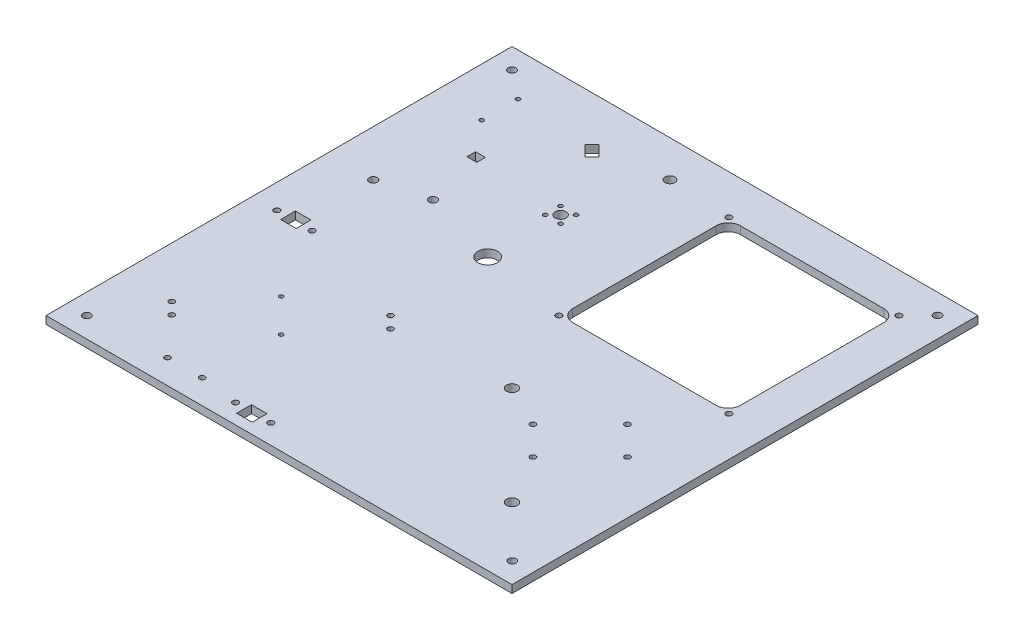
ISO-10303-21;
HEADER;
FILE_DESCRIPTION(('STEP AP214'),'2;1');
FILE_NAME('part.step','',(''),(''),'','','');
FILE_SCHEMA(('AUTOMOTIVE_DESIGN { 1 0 10303 214 1 1 1 1 }'));
ENDSEC;
DATA;
#1=APPLICATION_CONTEXT('core data for automotive mechanical design processes');
#2=APPLICATION_PROTOCOL_DEFINITION('international standard','automotive_design',2000,#1);
#3=PRODUCT_CONTEXT('',#1,'mechanical');
#4=PRODUCT('Part','Part','',(#3));
#5=PRODUCT_RELATED_PRODUCT_CATEGORY('part','',(#4));
#6=PRODUCT_DEFINITION_FORMATION('','',#4);
#7=PRODUCT_DEFINITION_CONTEXT('part definition',#1,'design');
#8=PRODUCT_DEFINITION('design','',#6,#7);
#9=PRODUCT_DEFINITION_SHAPE('','',#8);
#10=(LENGTH_UNIT() NAMED_UNIT(*) SI_UNIT(.MILLI.,.METRE.));
#11=(NAMED_UNIT(*) PLANE_ANGLE_UNIT() SI_UNIT($,.RADIAN.));
#12=(NAMED_UNIT(*) SI_UNIT($,.STERADIAN.) SOLID_ANGLE_UNIT());
#13=UNCERTAINTY_MEASURE_WITH_UNIT(LENGTH_MEASURE(1.E-05),#10,'distance_accuracy_value','');
#14=(GEOMETRIC_REPRESENTATION_CONTEXT(3) GLOBAL_UNCERTAINTY_ASSIGNED_CONTEXT((#13)) GLOBAL_UNIT_ASSIGNED_CONTEXT((#10,
#11,#12)) REPRESENTATION_CONTEXT('',''));
#15=CARTESIAN_POINT('',(0.,0.,0.));
#16=DIRECTION('',(0.,0.,1.));
#17=DIRECTION('',(1.,0.,0.));
#18=AXIS2_PLACEMENT_3D('',#15,#16,#17);
#19=CARTESIAN_POINT('',(0.,6.35,0.));
#20=DIRECTION('',(0.,-1.,0.));
#21=DIRECTION('',(0.,0.,-1.));
#22=AXIS2_PLACEMENT_3D('',#19,#20,#21);
#23=PLANE('',#22);
#24=CARTESIAN_POINT('',(-83.27,6.35,171.77));
#25=DIRECTION('',(0.,-1.,0.));
#26=DIRECTION('',(0.,0.,-1.));
#27=AXIS2_PLACEMENT_3D('',#24,#25,#26);
#28=CIRCLE('',#27,2.25);
#29=CARTESIAN_POINT('',(-83.27,6.35,169.52));
#30=VERTEX_POINT('',#29);
#31=EDGE_CURVE('E1309',#30,#30,#28,.T.);
#32=ORIENTED_EDGE('',*,*,#31,.T.);
#33=EDGE_LOOP('',(#32));
#34=FACE_BOUND('',#33,.T.);
#35=CARTESIAN_POINT('',(-111.77,6.35,171.77));
#36=DIRECTION('',(0.,-1.,0.));
#37=DIRECTION('',(0.,0.,-1.));
#38=AXIS2_PLACEMENT_3D('',#35,#36,#37);
#39=CIRCLE('',#38,2.25);
#40=CARTESIAN_POINT('',(-111.77,6.35,169.52));
#41=VERTEX_POINT('',#40);
#42=EDGE_CURVE('E1313',#41,#41,#39,.T.);
#43=ORIENTED_EDGE('',*,*,#42,.T.);
#44=EDGE_LOOP('',(#43));
#45=FACE_BOUND('',#44,.T.);
#46=CARTESIAN_POINT('',(-108.611805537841,6.35,81.3881944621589));
#47=DIRECTION('',(0.,1.,0.));
#48=DIRECTION('',(0.,0.,1.));
#49=AXIS2_PLACEMENT_3D('',#46,#47,#48);
#50=CIRCLE('',#49,1.69999999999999);
#51=CARTESIAN_POINT('',(-108.611805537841,6.35,83.0881944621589));
#52=VERTEX_POINT('',#51);
#53=EDGE_CURVE('E645',#52,#52,#50,.T.);
#54=ORIENTED_EDGE('',*,*,#53,.F.);
#55=EDGE_LOOP('',(#54));
#56=FACE_BOUND('',#55,.T.);
#57=CARTESIAN_POINT('',(-81.388194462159,6.35,108.611805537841));
#58=DIRECTION('',(0.,1.,0.));
#59=DIRECTION('',(0.,0.,1.));
#60=AXIS2_PLACEMENT_3D('',#57,#58,#59);
#61=CIRCLE('',#60,1.69999999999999);
#62=CARTESIAN_POINT('',(-81.388194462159,6.35,110.311805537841));
#63=VERTEX_POINT('',#62);
#64=EDGE_CURVE('E635',#63,#63,#61,.T.);
#65=ORIENTED_EDGE('',*,*,#64,.F.);
#66=EDGE_LOOP('',(#65));
#67=FACE_BOUND('',#66,.T.);
#68=CARTESIAN_POINT('',(-40.4540584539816,6.35,59.5459415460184));
#69=DIRECTION('',(0.,1.,0.));
#70=DIRECTION('',(0.,0.,1.));
#71=AXIS2_PLACEMENT_3D('',#68,#69,#70);
#72=CIRCLE('',#71,2.24999999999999);
#73=CARTESIAN_POINT('',(-40.4540584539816,6.35,61.7959415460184));
#74=VERTEX_POINT('',#73);
#75=EDGE_CURVE('E632',#74,#74,#72,.T.);
#76=ORIENTED_EDGE('',*,*,#75,.F.);
#77=EDGE_LOOP('',(#76));
#78=FACE_BOUND('',#77,.T.);
#79=CARTESIAN_POINT('',(-50.,6.35,50.));
#80=DIRECTION('',(0.,1.,0.));
#81=DIRECTION('',(0.,0.,1.));
#82=AXIS2_PLACEMENT_3D('',#79,#80,#81);
#83=CIRCLE('',#82,2.24999999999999);
#84=CARTESIAN_POINT('',(-50.,6.35,52.25));
#85=VERTEX_POINT('',#84);
#86=EDGE_CURVE('E629',#85,#85,#83,.T.);
#87=ORIENTED_EDGE('',*,*,#86,.F.);
#88=EDGE_LOOP('',(#87));
#89=FACE_BOUND('',#88,.T.);
#90=CARTESIAN_POINT('',(-140.454058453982,6.35,139.545941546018));
#91=DIRECTION('',(0.,1.,0.));
#92=DIRECTION('',(0.,0.,1.));
#93=AXIS2_PLACEMENT_3D('',#90,#91,#92);
#94=CIRCLE('',#93,2.25);
#95=CARTESIAN_POINT('',(-140.454058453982,6.35,141.795941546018));
#96=VERTEX_POINT('',#95);
#97=EDGE_CURVE('E625',#96,#96,#94,.T.);
#98=ORIENTED_EDGE('',*,*,#97,.F.);
#99=EDGE_LOOP('',(#98));
#100=FACE_BOUND('',#99,.T.);
#101=CARTESIAN_POINT('',(-150.,6.35,130.));
#102=DIRECTION('',(0.,1.,0.));
#103=DIRECTION('',(0.,0.,1.));
#104=AXIS2_PLACEMENT_3D('',#101,#102,#103);
#105=CIRCLE('',#104,2.25);
#106=CARTESIAN_POINT('',(-150.,6.35,132.25));
#107=VERTEX_POINT('',#106);
#108=EDGE_CURVE('E621',#107,#107,#105,.T.);
#109=ORIENTED_EDGE('',*,*,#108,.F.);
#110=EDGE_LOOP('',(#109));
#111=FACE_BOUND('',#110,.T.);
#112=DIRECTION('',(-1.,0.,0.));
#113=VECTOR('',#112,1.);
#114=CARTESIAN_POINT('',(-43.67,6.35,170.77));
#115=LINE('',#114,#113);
#116=CARTESIAN_POINT('',(-30.87,6.35,170.77));
#117=VERTEX_POINT('',#116);
#118=CARTESIAN_POINT('',(-43.67,6.35,170.77));
#119=VERTEX_POINT('',#118);
#120=EDGE_CURVE('E240',#117,#119,#115,.T.);
#121=ORIENTED_EDGE('',*,*,#120,.F.);
#122=DIRECTION('',(0.,0.,-1.));
#123=VECTOR('',#122,1.);
#124=CARTESIAN_POINT('',(-30.87,6.35,182.97));
#125=LINE('',#124,#123);
#126=CARTESIAN_POINT('',(-30.87,6.35,182.97));
#127=VERTEX_POINT('',#126);
#128=EDGE_CURVE('E54',#127,#117,#125,.T.);
#129=ORIENTED_EDGE('',*,*,#128,.F.);
#130=DIRECTION('',(1.,0.,0.));
#131=VECTOR('',#130,1.);
#132=CARTESIAN_POINT('',(-43.67,6.35,182.97));
#133=LINE('',#132,#131);
#134=CARTESIAN_POINT('',(-43.67,6.35,182.97));
#135=VERTEX_POINT('',#134);
#136=EDGE_CURVE('E246',#135,#127,#133,.T.);
#137=ORIENTED_EDGE('',*,*,#136,.F.);
#138=DIRECTION('',(0.,0.,1.));
#139=VECTOR('',#138,1.);
#140=CARTESIAN_POINT('',(-43.67,6.35,182.97));
#141=LINE('',#140,#139);
#142=EDGE_CURVE('E230',#119,#135,#141,.T.);
#143=ORIENTED_EDGE('',*,*,#142,.F.);
#144=EDGE_LOOP('',(#121,#129,#137,#143));
#145=FACE_BOUND('',#144,.T.);
#146=DIRECTION('',(-1.,0.,0.));
#147=VECTOR('',#146,1.);
#148=CARTESIAN_POINT('',(-163.67,6.35,14.57));
#149=LINE('',#148,#147);
#150=CARTESIAN_POINT('',(-150.87,6.35,14.57));
#151=VERTEX_POINT('',#150);
#152=CARTESIAN_POINT('',(-163.67,6.35,14.57));
#153=VERTEX_POINT('',#152);
#154=EDGE_CURVE('E257',#151,#153,#149,.T.);
#155=ORIENTED_EDGE('',*,*,#154,.F.);
#156=DIRECTION('',(0.,0.,-1.));
#157=VECTOR('',#156,1.);
#158=CARTESIAN_POINT('',(-150.87,6.35,26.77));
#159=LINE('',#158,#157);
#160=CARTESIAN_POINT('',(-150.87,6.35,26.77));
#161=VERTEX_POINT('',#160);
#162=EDGE_CURVE('E62',#161,#151,#159,.T.);
#163=ORIENTED_EDGE('',*,*,#162,.F.);
#164=DIRECTION('',(1.,0.,0.));
#165=VECTOR('',#164,1.);
#166=CARTESIAN_POINT('',(-163.67,6.35,26.77));
#167=LINE('',#166,#165);
#168=CARTESIAN_POINT('',(-163.67,6.35,26.77));
#169=VERTEX_POINT('',#168);
#170=EDGE_CURVE('E264',#169,#161,#167,.T.);
#171=ORIENTED_EDGE('',*,*,#170,.F.);
#172=DIRECTION('',(0.,0.,1.));
#173=VECTOR('',#172,1.);
#174=CARTESIAN_POINT('',(-163.67,6.35,26.77));
#175=LINE('',#174,#173);
#176=EDGE_CURVE('E261',#153,#169,#175,.T.);
#177=ORIENTED_EDGE('',*,*,#176,.F.);
#178=EDGE_LOOP('',(#155,#163,#171,#177));
#179=FACE_BOUND('',#178,.T.);
#180=CARTESIAN_POINT('',(-115.,6.35,-50.));
#181=DIRECTION('',(0.,1.,0.));
#182=DIRECTION('',(0.,0.,1.));
#183=AXIS2_PLACEMENT_3D('',#180,#181,#182);
#184=CIRCLE('',#183,3.3);
#185=CARTESIAN_POINT('',(-115.,6.35,-46.7));
#186=VERTEX_POINT('',#185);
#187=EDGE_CURVE('E253',#186,#186,#184,.T.);
#188=ORIENTED_EDGE('',*,*,#187,.F.);
#189=EDGE_LOOP('',(#188));
#190=FACE_BOUND('',#189,.T.);
#191=CARTESIAN_POINT('',(148.334523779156,6.35,53.3345237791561));
#192=DIRECTION('',(0.,-1.,0.));
#193=DIRECTION('',(0.,0.,-1.));
#194=AXIS2_PLACEMENT_3D('',#191,#192,#193);
#195=CIRCLE('',#194,2.25);
#196=CARTESIAN_POINT('',(148.334523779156,6.35,51.0845237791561));
#197=VERTEX_POINT('',#196);
#198=EDGE_CURVE('E285',#197,#197,#195,.T.);
#199=ORIENTED_EDGE('',*,*,#198,.T.);
#200=EDGE_LOOP('',(#199));
#201=FACE_BOUND('',#200,.T.);
#202=CARTESIAN_POINT('',(125.,6.35,30.));
#203=DIRECTION('',(0.,-1.,0.));
#204=DIRECTION('',(0.,0.,-1.));
#205=AXIS2_PLACEMENT_3D('',#202,#203,#204);
#206=CIRCLE('',#205,2.24999999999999);
#207=CARTESIAN_POINT('',(125.,6.35,27.75));
#208=VERTEX_POINT('',#207);
#209=EDGE_CURVE('E291',#208,#208,#206,.T.);
#210=ORIENTED_EDGE('',*,*,#209,.T.);
#211=EDGE_LOOP('',(#210));
#212=FACE_BOUND('',#211,.T.);
#213=CARTESIAN_POINT('',(109.443650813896,6.35,92.2253967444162));
#214=DIRECTION('',(0.,-1.,0.));
#215=DIRECTION('',(0.,0.,-1.));
#216=AXIS2_PLACEMENT_3D('',#213,#214,#215);
#217=CIRCLE('',#216,2.25);
#218=CARTESIAN_POINT('',(109.443650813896,6.35,89.9753967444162));
#219=VERTEX_POINT('',#218);
#220=EDGE_CURVE('E297',#219,#219,#217,.T.);
#221=ORIENTED_EDGE('',*,*,#220,.T.);
#222=EDGE_LOOP('',(#221));
#223=FACE_BOUND('',#222,.T.);
#224=CARTESIAN_POINT('',(86.1091270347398,6.35,68.8908729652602));
#225=DIRECTION('',(0.,-1.,0.));
#226=DIRECTION('',(0.,0.,-1.));
#227=AXIS2_PLACEMENT_3D('',#224,#225,#226);
#228=CIRCLE('',#227,2.25);
#229=CARTESIAN_POINT('',(86.1091270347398,6.35,66.6408729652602));
#230=VERTEX_POINT('',#229);
#231=EDGE_CURVE('E303',#230,#230,#228,.T.);
#232=ORIENTED_EDGE('',*,*,#231,.T.);
#233=EDGE_LOOP('',(#232));
#234=FACE_BOUND('',#233,.T.);
#235=DIRECTION('',(0.,0.,1.));
#236=VECTOR('',#235,1.);
#237=CARTESIAN_POINT('',(20.,6.35,-30.));
#238=LINE('',#237,#236);
#239=CARTESIAN_POINT('',(20.,6.35,-148.));
#240=VERTEX_POINT('',#239);
#241=CARTESIAN_POINT('',(20.,6.35,-30.));
#242=VERTEX_POINT('',#241);
#243=EDGE_CURVE('E334',#240,#242,#238,.T.);
#244=ORIENTED_EDGE('',*,*,#243,.F.);
#245=CARTESIAN_POINT('',(30.,6.35,-148.));
#246=DIRECTION('',(0.,1.,0.));
#247=DIRECTION('',(0.,0.,-1.));
#248=AXIS2_PLACEMENT_3D('',#245,#246,#247);
#249=CIRCLE('',#248,10.);
#250=CARTESIAN_POINT('',(30.,6.35,-158.));
#251=VERTEX_POINT('',#250);
#252=EDGE_CURVE('E306',#251,#240,#249,.T.);
#253=ORIENTED_EDGE('',*,*,#252,.F.);
#254=DIRECTION('',(-1.,0.,0.));
#255=VECTOR('',#254,1.);
#256=CARTESIAN_POINT('',(30.,6.35,-158.));
#257=LINE('',#256,#255);
#258=CARTESIAN_POINT('',(148.,6.35,-158.));
#259=VERTEX_POINT('',#258);
#260=EDGE_CURVE('E311',#259,#251,#257,.T.);
#261=ORIENTED_EDGE('',*,*,#260,.F.);
#262=CARTESIAN_POINT('',(148.,6.35,-148.));
#263=DIRECTION('',(0.,1.,0.));
#264=DIRECTION('',(0.,0.,-1.));
#265=AXIS2_PLACEMENT_3D('',#262,#263,#264);
#266=CIRCLE('',#265,9.99999999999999);
#267=CARTESIAN_POINT('',(158.,6.35,-148.));
#268=VERTEX_POINT('',#267);
#269=EDGE_CURVE('E349',#268,#259,#266,.T.);
#270=ORIENTED_EDGE('',*,*,#269,.F.);
#271=DIRECTION('',(0.,0.,-1.));
#272=VECTOR('',#271,1.);
#273=CARTESIAN_POINT('',(158.,6.35,-30.));
#274=LINE('',#273,#272);
#275=CARTESIAN_POINT('',(158.,6.35,-30.));
#276=VERTEX_POINT('',#275);
#277=EDGE_CURVE('E346',#276,#268,#274,.T.);
#278=ORIENTED_EDGE('',*,*,#277,.F.);
#279=CARTESIAN_POINT('',(148.,6.35,-30.));
#280=DIRECTION('',(0.,1.,0.));
#281=DIRECTION('',(0.,0.,-1.));
#282=AXIS2_PLACEMENT_3D('',#279,#280,#281);
#283=CIRCLE('',#282,10.);
#284=CARTESIAN_POINT('',(148.,6.35,-20.));
#285=VERTEX_POINT('',#284);
#286=EDGE_CURVE('E343',#285,#276,#283,.T.);
#287=ORIENTED_EDGE('',*,*,#286,.F.);
#288=DIRECTION('',(1.,0.,0.));
#289=VECTOR('',#288,1.);
#290=CARTESIAN_POINT('',(30.,6.35,-20.));
#291=LINE('',#290,#289);
#292=CARTESIAN_POINT('',(30.,6.35,-20.));
#293=VERTEX_POINT('',#292);
#294=EDGE_CURVE('E340',#293,#285,#291,.T.);
#295=ORIENTED_EDGE('',*,*,#294,.F.);
#296=CARTESIAN_POINT('',(30.,6.35,-30.));
#297=DIRECTION('',(0.,1.,0.));
#298=DIRECTION('',(0.,0.,-1.));
#299=AXIS2_PLACEMENT_3D('',#296,#297,#298);
#300=CIRCLE('',#299,10.);
#301=EDGE_CURVE('E337',#242,#293,#300,.T.);
#302=ORIENTED_EDGE('',*,*,#301,.F.);
#303=EDGE_LOOP('',(#244,#253,#261,#270,#278,#287,#295,#302));
#304=FACE_BOUND('',#303,.T.);
#305=CARTESIAN_POINT('',(19.2699999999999,6.35,-19.2699999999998));
#306=DIRECTION('',(0.,1.,0.));
#307=DIRECTION('',(0.,0.,1.));
#308=AXIS2_PLACEMENT_3D('',#305,#306,#307);
#309=CIRCLE('',#308,2.4);
#310=CARTESIAN_POINT('',(19.2699999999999,6.35,-16.8699999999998));
#311=VERTEX_POINT('',#310);
#312=EDGE_CURVE('E376',#311,#311,#309,.T.);
#313=ORIENTED_EDGE('',*,*,#312,.F.);
#314=EDGE_LOOP('',(#313));
#315=FACE_BOUND('',#314,.T.);
#316=CARTESIAN_POINT('',(19.2699999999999,6.35,-159.27));
#317=DIRECTION('',(0.,1.,0.));
#318=DIRECTION('',(0.,0.,1.));
#319=AXIS2_PLACEMENT_3D('',#316,#317,#318);
#320=CIRCLE('',#319,2.4);
#321=CARTESIAN_POINT('',(19.2699999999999,6.35,-156.87));
#322=VERTEX_POINT('',#321);
#323=EDGE_CURVE('E382',#322,#322,#320,.T.);
#324=ORIENTED_EDGE('',*,*,#323,.F.);
#325=EDGE_LOOP('',(#324));
#326=FACE_BOUND('',#325,.T.);
#327=CARTESIAN_POINT('',(159.27,6.35,-159.27));
#328=DIRECTION('',(0.,1.,0.));
#329=DIRECTION('',(0.,0.,1.));
#330=AXIS2_PLACEMENT_3D('',#327,#328,#329);
#331=CIRCLE('',#330,2.39999999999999);
#332=CARTESIAN_POINT('',(159.27,6.35,-156.87));
#333=VERTEX_POINT('',#332);
#334=EDGE_CURVE('E388',#333,#333,#331,.T.);
#335=ORIENTED_EDGE('',*,*,#334,.F.);
#336=EDGE_LOOP('',(#335));
#337=FACE_BOUND('',#336,.T.);
#338=CARTESIAN_POINT('',(-51.77,6.35,-31.77));
#339=DIRECTION('',(0.,1.,0.));
#340=DIRECTION('',(0.,0.,1.));
#341=AXIS2_PLACEMENT_3D('',#338,#339,#340);
#342=CIRCLE('',#341,8.1);
#343=CARTESIAN_POINT('',(-51.77,6.35,-23.67));
#344=VERTEX_POINT('',#343);
#345=EDGE_CURVE('E399',#344,#344,#342,.T.);
#346=ORIENTED_EDGE('',*,*,#345,.F.);
#347=EDGE_LOOP('',(#346));
#348=FACE_BOUND('',#347,.T.);
#349=CARTESIAN_POINT('',(-31.77,6.35,-161.77));
#350=DIRECTION('',(0.,1.,0.));
#351=DIRECTION('',(0.,0.,1.));
#352=AXIS2_PLACEMENT_3D('',#349,#350,#351);
#353=CIRCLE('',#352,4.06000000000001);
#354=CARTESIAN_POINT('',(-31.77,6.35,-157.71));
#355=VERTEX_POINT('',#354);
#356=EDGE_CURVE('E405',#355,#355,#353,.T.);
#357=ORIENTED_EDGE('',*,*,#356,.F.);
#358=EDGE_LOOP('',(#357));
#359=FACE_BOUND('',#358,.T.);
#360=DIRECTION('',(0.70710678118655,0.,0.707106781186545));
#361=VECTOR('',#360,1.);
#362=CARTESIAN_POINT('',(-91.77,6.35,-151.77));
#363=LINE('',#362,#361);
#364=CARTESIAN_POINT('',(-91.77,6.35,-151.77));
#365=VERTEX_POINT('',#364);
#366=CARTESIAN_POINT('',(-83.1857236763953,6.35,-143.185723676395));
#367=VERTEX_POINT('',#366);
#368=EDGE_CURVE('E425',#365,#367,#363,.T.);
#369=ORIENTED_EDGE('',*,*,#368,.F.);
#370=DIRECTION('',(-0.707106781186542,0.,0.707106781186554));
#371=VECTOR('',#370,1.);
#372=CARTESIAN_POINT('',(-86.0282929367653,6.35,-157.511707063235));
#373=LINE('',#372,#371);
#374=CARTESIAN_POINT('',(-86.0282929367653,6.35,-157.511707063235));
#375=VERTEX_POINT('',#374);
#376=EDGE_CURVE('E423',#375,#365,#373,.T.);
#377=ORIENTED_EDGE('',*,*,#376,.F.);
#378=DIRECTION('',(-0.707106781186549,0.,-0.707106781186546));
#379=VECTOR('',#378,1.);
#380=CARTESIAN_POINT('',(-77.4440166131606,6.35,-148.92743073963));
#381=LINE('',#380,#379);
#382=CARTESIAN_POINT('',(-77.4440166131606,6.35,-148.92743073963));
#383=VERTEX_POINT('',#382);
#384=EDGE_CURVE('E413',#383,#375,#381,.T.);
#385=ORIENTED_EDGE('',*,*,#384,.F.);
#386=DIRECTION('',(0.70710678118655,0.,-0.707106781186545));
#387=VECTOR('',#386,1.);
#388=CARTESIAN_POINT('',(-83.1857236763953,6.35,-143.185723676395));
#389=LINE('',#388,#387);
#390=EDGE_CURVE('E429',#367,#383,#389,.T.);
#391=ORIENTED_EDGE('',*,*,#390,.F.);
#392=EDGE_LOOP('',(#369,#377,#385,#391));
#393=FACE_BOUND('',#392,.T.);
#394=DIRECTION('',(0.,0.,1.));
#395=VECTOR('',#394,1.);
#396=CARTESIAN_POINT('',(-131.77,6.35,-101.77));
#397=LINE('',#396,#395);
#398=CARTESIAN_POINT('',(-131.77,6.35,-101.77));
#399=VERTEX_POINT('',#398);
#400=CARTESIAN_POINT('',(-131.77,6.35,-94.65));
#401=VERTEX_POINT('',#400);
#402=EDGE_CURVE('E457',#399,#401,#397,.T.);
#403=ORIENTED_EDGE('',*,*,#402,.F.);
#404=DIRECTION('',(-1.,0.,0.));
#405=VECTOR('',#404,1.);
#406=CARTESIAN_POINT('',(-123.65,6.35,-101.77));
#407=LINE('',#406,#405);
#408=CARTESIAN_POINT('',(-123.65,6.35,-101.77));
#409=VERTEX_POINT('',#408);
#410=EDGE_CURVE('E455',#409,#399,#407,.T.);
#411=ORIENTED_EDGE('',*,*,#410,.F.);
#412=DIRECTION('',(0.,0.,-1.));
#413=VECTOR('',#412,1.);
#414=CARTESIAN_POINT('',(-123.65,6.35,-94.65));
#415=LINE('',#414,#413);
#416=CARTESIAN_POINT('',(-123.65,6.35,-94.65));
#417=VERTEX_POINT('',#416);
#418=EDGE_CURVE('E445',#417,#409,#415,.T.);
#419=ORIENTED_EDGE('',*,*,#418,.F.);
#420=DIRECTION('',(1.,0.,0.));
#421=VECTOR('',#420,1.);
#422=CARTESIAN_POINT('',(-131.77,6.35,-94.65));
#423=LINE('',#422,#421);
#424=EDGE_CURVE('E461',#401,#417,#423,.T.);
#425=ORIENTED_EDGE('',*,*,#424,.F.);
#426=EDGE_LOOP('',(#403,#411,#419,#425));
#427=FACE_BOUND('',#426,.T.);
#428=CARTESIAN_POINT('',(-51.77,6.35,-91.77));
#429=DIRECTION('',(0.,1.,0.));
#430=DIRECTION('',(0.,0.,1.));
#431=AXIS2_PLACEMENT_3D('',#428,#429,#430);
#432=CIRCLE('',#431,4.5);
#433=CARTESIAN_POINT('',(-51.77,6.35,-87.27));
#434=VERTEX_POINT('',#433);
#435=EDGE_CURVE('E394',#434,#434,#432,.T.);
#436=ORIENTED_EDGE('',*,*,#435,.F.);
#437=EDGE_LOOP('',(#436));
#438=FACE_BOUND('',#437,.T.);
#439=CARTESIAN_POINT('',(-151.77,6.35,-156.77));
#440=DIRECTION('',(0.,1.,0.));
#441=DIRECTION('',(0.,0.,1.));
#442=AXIS2_PLACEMENT_3D('',#439,#440,#441);
#443=CIRCLE('',#442,1.70000000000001);
#444=CARTESIAN_POINT('',(-151.77,6.35,-155.07));
#445=VERTEX_POINT('',#444);
#446=EDGE_CURVE('E398',#445,#445,#443,.T.);
#447=ORIENTED_EDGE('',*,*,#446,.F.);
#448=EDGE_LOOP('',(#447));
#449=FACE_BOUND('',#448,.T.);
#450=CARTESIAN_POINT('',(-151.77,6.35,-126.77));
#451=DIRECTION('',(0.,1.,0.));
#452=DIRECTION('',(0.,0.,1.));
#453=AXIS2_PLACEMENT_3D('',#450,#451,#452);
#454=CIRCLE('',#453,1.70000000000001);
#455=CARTESIAN_POINT('',(-151.77,6.35,-125.07));
#456=VERTEX_POINT('',#455);
#457=EDGE_CURVE('E480',#456,#456,#454,.T.);
#458=ORIENTED_EDGE('',*,*,#457,.F.);
#459=EDGE_LOOP('',(#458));
#460=FACE_BOUND('',#459,.T.);
#461=CARTESIAN_POINT('',(-58.09,6.35,-85.44));
#462=DIRECTION('',(0.,1.,0.));
#463=DIRECTION('',(0.,0.,1.));
#464=AXIS2_PLACEMENT_3D('',#461,#462,#463);
#465=CIRCLE('',#464,1.7);
#466=CARTESIAN_POINT('',(-58.09,6.35,-83.74));
#467=VERTEX_POINT('',#466);
#468=EDGE_CURVE('E484',#467,#467,#465,.T.);
#469=ORIENTED_EDGE('',*,*,#468,.F.);
#470=EDGE_LOOP('',(#469));
#471=FACE_BOUND('',#470,.T.);
#472=CARTESIAN_POINT('',(-45.44,6.35,-85.44));
#473=DIRECTION('',(0.,1.,0.));
#474=DIRECTION('',(0.,0.,1.));
#475=AXIS2_PLACEMENT_3D('',#472,#473,#474);
#476=CIRCLE('',#475,1.7);
#477=CARTESIAN_POINT('',(-45.44,6.35,-83.74));
#478=VERTEX_POINT('',#477);
#479=EDGE_CURVE('E488',#478,#478,#476,.T.);
#480=ORIENTED_EDGE('',*,*,#479,.F.);
#481=EDGE_LOOP('',(#480));
#482=FACE_BOUND('',#481,.T.);
#483=CARTESIAN_POINT('',(-45.44,6.35,-98.09));
#484=DIRECTION('',(0.,1.,0.));
#485=DIRECTION('',(0.,0.,1.));
#486=AXIS2_PLACEMENT_3D('',#483,#484,#485);
#487=CIRCLE('',#486,1.7);
#488=CARTESIAN_POINT('',(-45.44,6.35,-96.39));
#489=VERTEX_POINT('',#488);
#490=EDGE_CURVE('E492',#489,#489,#487,.T.);
#491=ORIENTED_EDGE('',*,*,#490,.F.);
#492=EDGE_LOOP('',(#491));
#493=FACE_BOUND('',#492,.T.);
#494=CARTESIAN_POINT('',(-58.09,6.35,-98.09));
#495=DIRECTION('',(0.,1.,0.));
#496=DIRECTION('',(0.,0.,1.));
#497=AXIS2_PLACEMENT_3D('',#494,#495,#496);
#498=CIRCLE('',#497,1.7);
#499=CARTESIAN_POINT('',(-58.09,6.35,-96.39));
#500=VERTEX_POINT('',#499);
#501=EDGE_CURVE('E496',#500,#500,#498,.T.);
#502=ORIENTED_EDGE('',*,*,#501,.F.);
#503=EDGE_LOOP('',(#502));
#504=FACE_BOUND('',#503,.T.);
#505=CARTESIAN_POINT('',(51.77,6.35,51.77));
#506=DIRECTION('',(0.,1.,0.));
#507=DIRECTION('',(0.,0.,1.));
#508=AXIS2_PLACEMENT_3D('',#505,#506,#507);
#509=CIRCLE('',#508,4.5);
#510=CARTESIAN_POINT('',(51.77,6.35,56.27));
#511=VERTEX_POINT('',#510);
#512=EDGE_CURVE('E500',#511,#511,#509,.T.);
#513=ORIENTED_EDGE('',*,*,#512,.F.);
#514=EDGE_LOOP('',(#513));
#515=FACE_BOUND('',#514,.T.);
#516=CARTESIAN_POINT('',(133.087279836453,6.35,133.087279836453));
#517=DIRECTION('',(0.,1.,0.));
#518=DIRECTION('',(0.,0.,1.));
#519=AXIS2_PLACEMENT_3D('',#516,#517,#518);
#520=CIRCLE('',#519,4.5);
#521=CARTESIAN_POINT('',(133.087279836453,6.35,137.587279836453));
#522=VERTEX_POINT('',#521);
#523=EDGE_CURVE('E504',#522,#522,#520,.T.);
#524=ORIENTED_EDGE('',*,*,#523,.F.);
#525=EDGE_LOOP('',(#524));
#526=FACE_BOUND('',#525,.T.);
#527=CARTESIAN_POINT('',(-51.77,6.35,175.77));
#528=DIRECTION('',(0.,1.,0.));
#529=DIRECTION('',(0.,0.,1.));
#530=AXIS2_PLACEMENT_3D('',#527,#528,#529);
#531=CIRCLE('',#530,2.4);
#532=CARTESIAN_POINT('',(-51.77,6.35,178.17));
#533=VERTEX_POINT('',#532);
#534=EDGE_CURVE('E510',#533,#533,#531,.T.);
#535=ORIENTED_EDGE('',*,*,#534,.F.);
#536=EDGE_LOOP('',(#535));
#537=FACE_BOUND('',#536,.T.);
#538=CARTESIAN_POINT('',(-22.77,6.35,175.77));
#539=DIRECTION('',(0.,1.,0.));
#540=DIRECTION('',(0.,0.,1.));
#541=AXIS2_PLACEMENT_3D('',#538,#539,#540);
#542=CIRCLE('',#541,2.4);
#543=CARTESIAN_POINT('',(-22.77,6.35,178.17));
#544=VERTEX_POINT('',#543);
#545=EDGE_CURVE('E514',#544,#544,#542,.T.);
#546=ORIENTED_EDGE('',*,*,#545,.F.);
#547=EDGE_LOOP('',(#546));
#548=FACE_BOUND('',#547,.T.);
#549=CARTESIAN_POINT('',(-171.77,6.35,21.77));
#550=DIRECTION('',(0.,1.,0.));
#551=DIRECTION('',(0.,0.,1.));
#552=AXIS2_PLACEMENT_3D('',#549,#550,#551);
#553=CIRCLE('',#552,2.39999999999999);
#554=CARTESIAN_POINT('',(-171.77,6.35,24.17));
#555=VERTEX_POINT('',#554);
#556=EDGE_CURVE('E520',#555,#555,#553,.T.);
#557=ORIENTED_EDGE('',*,*,#556,.F.);
#558=EDGE_LOOP('',(#557));
#559=FACE_BOUND('',#558,.T.);
#560=CARTESIAN_POINT('',(-142.77,6.35,21.77));
#561=DIRECTION('',(0.,1.,0.));
#562=DIRECTION('',(0.,0.,1.));
#563=AXIS2_PLACEMENT_3D('',#560,#561,#562);
#564=CIRCLE('',#563,2.39999999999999);
#565=CARTESIAN_POINT('',(-142.77,6.35,24.17));
#566=VERTEX_POINT('',#565);
#567=EDGE_CURVE('E526',#566,#566,#564,.T.);
#568=ORIENTED_EDGE('',*,*,#567,.F.);
#569=EDGE_LOOP('',(#568));
#570=FACE_BOUND('',#569,.T.);
#571=CARTESIAN_POINT('',(-175.,6.35,175.));
#572=DIRECTION('',(0.,1.,0.));
#573=DIRECTION('',(0.,0.,1.));
#574=AXIS2_PLACEMENT_3D('',#571,#572,#573);
#575=CIRCLE('',#574,3.17500000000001);
#576=CARTESIAN_POINT('',(-175.,6.35,178.175));
#577=VERTEX_POINT('',#576);
#578=EDGE_CURVE('E532',#577,#577,#575,.T.);
#579=ORIENTED_EDGE('',*,*,#578,.F.);
#580=EDGE_LOOP('',(#579));
#581=FACE_BOUND('',#580,.T.);
#582=CARTESIAN_POINT('',(-175.,6.35,-175.));
#583=DIRECTION('',(0.,1.,0.));
#584=DIRECTION('',(0.,0.,1.));
#585=AXIS2_PLACEMENT_3D('',#582,#583,#584);
#586=CIRCLE('',#585,3.17500000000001);
#587=CARTESIAN_POINT('',(-175.,6.35,-171.825));
#588=VERTEX_POINT('',#587);
#589=EDGE_CURVE('E538',#588,#588,#586,.T.);
#590=ORIENTED_EDGE('',*,*,#589,.F.);
#591=EDGE_LOOP('',(#590));
#592=FACE_BOUND('',#591,.T.);
#593=CARTESIAN_POINT('',(175.,6.35,-175.23));
#594=DIRECTION('',(0.,1.,0.));
#595=DIRECTION('',(0.,0.,1.));
#596=AXIS2_PLACEMENT_3D('',#593,#594,#595);
#597=CIRCLE('',#596,3.17500000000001);
#598=CARTESIAN_POINT('',(175.,6.35,-172.055));
#599=VERTEX_POINT('',#598);
#600=EDGE_CURVE('E544',#599,#599,#597,.T.);
#601=ORIENTED_EDGE('',*,*,#600,.F.);
#602=EDGE_LOOP('',(#601));
#603=FACE_BOUND('',#602,.T.);
#604=CARTESIAN_POINT('',(175.,6.35,174.77));
#605=DIRECTION('',(0.,1.,0.));
#606=DIRECTION('',(0.,0.,1.));
#607=AXIS2_PLACEMENT_3D('',#604,#605,#606);
#608=CIRCLE('',#607,3.17500000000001);
#609=CARTESIAN_POINT('',(175.,6.35,177.945));
#610=VERTEX_POINT('',#609);
#611=EDGE_CURVE('E550',#610,#610,#608,.T.);
#612=ORIENTED_EDGE('',*,*,#611,.F.);
#613=EDGE_LOOP('',(#612));
#614=FACE_BOUND('',#613,.T.);
#615=DIRECTION('',(0.,0.,-1.));
#616=VECTOR('',#615,1.);
#617=CARTESIAN_POINT('',(191.77,6.35,191.77));
#618=LINE('',#617,#616);
#619=CARTESIAN_POINT('',(191.77,6.35,191.77));
#620=VERTEX_POINT('',#619);
#621=CARTESIAN_POINT('',(191.77,6.35,-191.77));
#622=VERTEX_POINT('',#621);
#623=EDGE_CURVE('E557',#620,#622,#618,.T.);
#624=ORIENTED_EDGE('',*,*,#623,.T.);
#625=DIRECTION('',(-1.,0.,0.));
#626=VECTOR('',#625,1.);
#627=CARTESIAN_POINT('',(-191.77,6.35,-191.77));
#628=LINE('',#627,#626);
#629=CARTESIAN_POINT('',(-191.77,6.35,-191.77));
#630=VERTEX_POINT('',#629);
#631=EDGE_CURVE('E560',#622,#630,#628,.T.);
#632=ORIENTED_EDGE('',*,*,#631,.T.);
#633=DIRECTION('',(0.,0.,1.));
#634=VECTOR('',#633,1.);
#635=CARTESIAN_POINT('',(-191.77,6.35,191.77));
#636=LINE('',#635,#634);
#637=CARTESIAN_POINT('',(-191.77,6.35,191.77));
#638=VERTEX_POINT('',#637);
#639=EDGE_CURVE('E563',#630,#638,#636,.T.);
#640=ORIENTED_EDGE('',*,*,#639,.T.);
#641=DIRECTION('',(1.,0.,0.));
#642=VECTOR('',#641,1.);
#643=CARTESIAN_POINT('',(-191.77,6.35,191.77));
#644=LINE('',#643,#642);
#645=EDGE_CURVE('E565',#638,#620,#644,.T.);
#646=ORIENTED_EDGE('',*,*,#645,.T.);
#647=EDGE_LOOP('',(#624,#632,#640,#646));
#648=FACE_BOUND('',#647,.T.);
#649=CARTESIAN_POINT('',(159.27,6.35,-19.2699999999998));
#650=DIRECTION('',(0.,1.,0.));
#651=DIRECTION('',(0.,0.,1.));
#652=AXIS2_PLACEMENT_3D('',#649,#650,#651);
#653=CIRCLE('',#652,2.39999999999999);
#654=CARTESIAN_POINT('',(159.27,6.35,-16.8699999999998));
#655=VERTEX_POINT('',#654);
#656=EDGE_CURVE('E356',#655,#655,#653,.T.);
#657=ORIENTED_EDGE('',*,*,#656,.F.);
#658=EDGE_LOOP('',(#657));
#659=FACE_BOUND('',#658,.T.);
#660=CARTESIAN_POINT('',(-153.830218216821,6.35,-39.5954743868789));
#661=DIRECTION('',(0.,1.,0.));
#662=DIRECTION('',(0.,0.,1.));
#663=AXIS2_PLACEMENT_3D('',#660,#661,#662);
#664=CIRCLE('',#663,3.3);
#665=CARTESIAN_POINT('',(-153.830218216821,6.35,-36.2954743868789));
#666=VERTEX_POINT('',#665);
#667=EDGE_CURVE('E278',#666,#666,#664,.T.);
#668=ORIENTED_EDGE('',*,*,#667,.F.);
#669=EDGE_LOOP('',(#668));
#670=FACE_BOUND('',#669,.T.);
#671=ADVANCED_FACE('F37',(#34,#45,#56,#67,#78,#89,#100,#111,#145,#179,#190,#201,#212,#223,#234,
#304,#315,#326,#337,#348,#359,#393,#427,#438,#449,#460,#471,#482,#493,#504,#515,#526,#537,#548,
#559,#570,#581,#592,#603,#614,#648,#659,#670),#23,.F.);
#672=CARTESIAN_POINT('',(191.77,6.35,191.77));
#673=DIRECTION('',(-1.,0.,0.));
#674=DIRECTION('',(0.,0.,1.));
#675=AXIS2_PLACEMENT_3D('',#672,#673,#674);
#676=PLANE('',#675);
#677=DIRECTION('',(0.,0.,-1.));
#678=VECTOR('',#677,1.);
#679=CARTESIAN_POINT('',(191.77,0.,191.77));
#680=LINE('',#679,#678);
#681=CARTESIAN_POINT('',(191.77,0.,191.77));
#682=VERTEX_POINT('',#681);
#683=CARTESIAN_POINT('',(191.77,0.,-191.77));
#684=VERTEX_POINT('',#683);
#685=EDGE_CURVE('E556',#682,#684,#680,.T.);
#686=ORIENTED_EDGE('',*,*,#685,.T.);
#687=DIRECTION('',(0.,-1.,0.));
#688=VECTOR('',#687,1.);
#689=CARTESIAN_POINT('',(191.77,6.35,-191.77));
#690=LINE('',#689,#688);
#691=EDGE_CURVE('E583',#622,#684,#690,.T.);
#692=ORIENTED_EDGE('',*,*,#691,.F.);
#693=ORIENTED_EDGE('',*,*,#623,.F.);
#694=DIRECTION('',(0.,-1.,0.));
#695=VECTOR('',#694,1.);
#696=CARTESIAN_POINT('',(191.77,6.35,191.77));
#697=LINE('',#696,#695);
#698=EDGE_CURVE('E567',#620,#682,#697,.T.);
#699=ORIENTED_EDGE('',*,*,#698,.T.);
#700=EDGE_LOOP('',(#686,#692,#693,#699));
#701=FACE_BOUND('',#700,.T.);
#702=ADVANCED_FACE('F39',(#701),#676,.F.);
#703=CARTESIAN_POINT('',(-191.77,6.35,-191.77));
#704=DIRECTION('',(0.,0.,1.));
#705=DIRECTION('',(1.,0.,0.));
#706=AXIS2_PLACEMENT_3D('',#703,#704,#705);
#707=PLANE('',#706);
#708=DIRECTION('',(-1.,0.,0.));
#709=VECTOR('',#708,1.);
#710=CARTESIAN_POINT('',(-191.77,0.,-191.77));
#711=LINE('',#710,#709);
#712=CARTESIAN_POINT('',(-191.77,0.,-191.77));
#713=VERTEX_POINT('',#712);
#714=EDGE_CURVE('E570',#684,#713,#711,.T.);
#715=ORIENTED_EDGE('',*,*,#714,.T.);
#716=DIRECTION('',(0.,-1.,0.));
#717=VECTOR('',#716,1.);
#718=CARTESIAN_POINT('',(-191.77,6.35,-191.77));
#719=LINE('',#718,#717);
#720=EDGE_CURVE('E580',#630,#713,#719,.T.);
#721=ORIENTED_EDGE('',*,*,#720,.F.);
#722=ORIENTED_EDGE('',*,*,#631,.F.);
#723=ORIENTED_EDGE('',*,*,#691,.T.);
#724=EDGE_LOOP('',(#715,#721,#722,#723));
#725=FACE_BOUND('',#724,.T.);
#726=ADVANCED_FACE('F664',(#725),#707,.F.);
#727=CARTESIAN_POINT('',(-191.77,6.35,191.77));
#728=DIRECTION('',(1.,0.,0.));
#729=DIRECTION('',(0.,0.,-1.));
#730=AXIS2_PLACEMENT_3D('',#727,#728,#729);
#731=PLANE('',#730);
#732=DIRECTION('',(0.,0.,1.));
#733=VECTOR('',#732,1.);
#734=CARTESIAN_POINT('',(-191.77,0.,191.77));
#735=LINE('',#734,#733);
#736=CARTESIAN_POINT('',(-191.77,0.,191.77));
#737=VERTEX_POINT('',#736);
#738=EDGE_CURVE('E572',#713,#737,#735,.T.);
#739=ORIENTED_EDGE('',*,*,#738,.T.);
#740=DIRECTION('',(0.,-1.,0.));
#741=VECTOR('',#740,1.);
#742=CARTESIAN_POINT('',(-191.77,6.35,191.77));
#743=LINE('',#742,#741);
#744=EDGE_CURVE('E577',#638,#737,#743,.T.);
#745=ORIENTED_EDGE('',*,*,#744,.F.);
#746=ORIENTED_EDGE('',*,*,#639,.F.);
#747=ORIENTED_EDGE('',*,*,#720,.T.);
#748=EDGE_LOOP('',(#739,#745,#746,#747));
#749=FACE_BOUND('',#748,.T.);
#750=ADVANCED_FACE('F679',(#749),#731,.F.);
#751=CARTESIAN_POINT('',(-191.77,6.35,191.77));
#752=DIRECTION('',(0.,0.,-1.));
#753=DIRECTION('',(-1.,0.,0.));
#754=AXIS2_PLACEMENT_3D('',#751,#752,#753);
#755=PLANE('',#754);
#756=DIRECTION('',(1.,0.,0.));
#757=VECTOR('',#756,1.);
#758=CARTESIAN_POINT('',(-191.77,0.,191.77));
#759=LINE('',#758,#757);
#760=EDGE_CURVE('E561',#737,#682,#759,.T.);
#761=ORIENTED_EDGE('',*,*,#760,.T.);
#762=ORIENTED_EDGE('',*,*,#698,.F.);
#763=ORIENTED_EDGE('',*,*,#645,.F.);
#764=ORIENTED_EDGE('',*,*,#744,.T.);
#765=EDGE_LOOP('',(#761,#762,#763,#764));
#766=FACE_BOUND('',#765,.T.);
#767=ADVANCED_FACE('F675',(#766),#755,.F.);
#768=CARTESIAN_POINT('',(0.,0.,0.));
#769=DIRECTION('',(0.,-1.,0.));
#770=DIRECTION('',(0.,0.,-1.));
#771=AXIS2_PLACEMENT_3D('',#768,#769,#770);
#772=PLANE('',#771);
#773=CARTESIAN_POINT('',(-83.27,0.,171.77));
#774=DIRECTION('',(0.,-1.,0.));
#775=DIRECTION('',(0.,0.,-1.));
#776=AXIS2_PLACEMENT_3D('',#773,#774,#775);
#777=CIRCLE('',#776,2.25);
#778=CARTESIAN_POINT('',(-83.27,0.,169.52));
#779=VERTEX_POINT('',#778);
#780=EDGE_CURVE('E1307',#779,#779,#777,.T.);
#781=ORIENTED_EDGE('',*,*,#780,.F.);
#782=EDGE_LOOP('',(#781));
#783=FACE_BOUND('',#782,.T.);
#784=CARTESIAN_POINT('',(-111.77,0.,171.77));
#785=DIRECTION('',(0.,-1.,0.));
#786=DIRECTION('',(0.,0.,-1.));
#787=AXIS2_PLACEMENT_3D('',#784,#785,#786);
#788=CIRCLE('',#787,2.25);
#789=CARTESIAN_POINT('',(-111.77,0.,169.52));
#790=VERTEX_POINT('',#789);
#791=EDGE_CURVE('E1310',#790,#790,#788,.T.);
#792=ORIENTED_EDGE('',*,*,#791,.F.);
#793=EDGE_LOOP('',(#792));
#794=FACE_BOUND('',#793,.T.);
#795=CARTESIAN_POINT('',(-108.611805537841,0.,81.3881944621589));
#796=DIRECTION('',(0.,-1.,0.));
#797=DIRECTION('',(0.,0.,-1.));
#798=AXIS2_PLACEMENT_3D('',#795,#796,#797);
#799=CIRCLE('',#798,1.69999999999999);
#800=CARTESIAN_POINT('',(-108.611805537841,0.,79.6881944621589));
#801=VERTEX_POINT('',#800);
#802=EDGE_CURVE('E41',#801,#801,#799,.T.);
#803=ORIENTED_EDGE('',*,*,#802,.F.);
#804=EDGE_LOOP('',(#803));
#805=FACE_BOUND('',#804,.T.);
#806=CARTESIAN_POINT('',(-81.388194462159,0.,108.611805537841));
#807=DIRECTION('',(0.,-1.,0.));
#808=DIRECTION('',(0.,0.,-1.));
#809=AXIS2_PLACEMENT_3D('',#806,#807,#808);
#810=CIRCLE('',#809,1.69999999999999);
#811=CARTESIAN_POINT('',(-81.388194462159,0.,106.911805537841));
#812=VERTEX_POINT('',#811);
#813=EDGE_CURVE('E633',#812,#812,#810,.T.);
#814=ORIENTED_EDGE('',*,*,#813,.F.);
#815=EDGE_LOOP('',(#814));
#816=FACE_BOUND('',#815,.T.);
#817=CARTESIAN_POINT('',(-40.4540584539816,0.,59.5459415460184));
#818=DIRECTION('',(0.,-1.,0.));
#819=DIRECTION('',(0.,0.,-1.));
#820=AXIS2_PLACEMENT_3D('',#817,#818,#819);
#821=CIRCLE('',#820,2.24999999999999);
#822=CARTESIAN_POINT('',(-40.4540584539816,0.,57.2959415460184));
#823=VERTEX_POINT('',#822);
#824=EDGE_CURVE('E630',#823,#823,#821,.T.);
#825=ORIENTED_EDGE('',*,*,#824,.F.);
#826=EDGE_LOOP('',(#825));
#827=FACE_BOUND('',#826,.T.);
#828=CARTESIAN_POINT('',(-50.,0.,50.));
#829=DIRECTION('',(0.,-1.,0.));
#830=DIRECTION('',(0.,0.,-1.));
#831=AXIS2_PLACEMENT_3D('',#828,#829,#830);
#832=CIRCLE('',#831,2.24999999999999);
#833=CARTESIAN_POINT('',(-50.,0.,47.75));
#834=VERTEX_POINT('',#833);
#835=EDGE_CURVE('E626',#834,#834,#832,.T.);
#836=ORIENTED_EDGE('',*,*,#835,.F.);
#837=EDGE_LOOP('',(#836));
#838=FACE_BOUND('',#837,.T.);
#839=CARTESIAN_POINT('',(-140.454058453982,0.,139.545941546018));
#840=DIRECTION('',(0.,-1.,0.));
#841=DIRECTION('',(0.,0.,-1.));
#842=AXIS2_PLACEMENT_3D('',#839,#840,#841);
#843=CIRCLE('',#842,2.25);
#844=CARTESIAN_POINT('',(-140.454058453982,0.,137.295941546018));
#845=VERTEX_POINT('',#844);
#846=EDGE_CURVE('E622',#845,#845,#843,.T.);
#847=ORIENTED_EDGE('',*,*,#846,.F.);
#848=EDGE_LOOP('',(#847));
#849=FACE_BOUND('',#848,.T.);
#850=CARTESIAN_POINT('',(-150.,0.,130.));
#851=DIRECTION('',(0.,-1.,0.));
#852=DIRECTION('',(0.,0.,-1.));
#853=AXIS2_PLACEMENT_3D('',#850,#851,#852);
#854=CIRCLE('',#853,2.25);
#855=CARTESIAN_POINT('',(-150.,0.,127.75));
#856=VERTEX_POINT('',#855);
#857=EDGE_CURVE('E258',#856,#856,#854,.T.);
#858=ORIENTED_EDGE('',*,*,#857,.F.);
#859=EDGE_LOOP('',(#858));
#860=FACE_BOUND('',#859,.T.);
#861=DIRECTION('',(0.,0.,1.));
#862=VECTOR('',#861,1.);
#863=CARTESIAN_POINT('',(-30.87,0.,0.));
#864=LINE('',#863,#862);
#865=CARTESIAN_POINT('',(-30.87,0.,170.77));
#866=VERTEX_POINT('',#865);
#867=CARTESIAN_POINT('',(-30.87,0.,182.97));
#868=VERTEX_POINT('',#867);
#869=EDGE_CURVE('E11',#866,#868,#864,.T.);
#870=ORIENTED_EDGE('',*,*,#869,.F.);
#871=DIRECTION('',(1.,0.,0.));
#872=VECTOR('',#871,1.);
#873=CARTESIAN_POINT('',(0.,0.,170.77));
#874=LINE('',#873,#872);
#875=CARTESIAN_POINT('',(-43.67,0.,170.77));
#876=VERTEX_POINT('',#875);
#877=EDGE_CURVE('E615',#876,#866,#874,.T.);
#878=ORIENTED_EDGE('',*,*,#877,.F.);
#879=DIRECTION('',(0.,0.,-1.));
#880=VECTOR('',#879,1.);
#881=CARTESIAN_POINT('',(-43.67,0.,0.));
#882=LINE('',#881,#880);
#883=CARTESIAN_POINT('',(-43.67,0.,182.97));
#884=VERTEX_POINT('',#883);
#885=EDGE_CURVE('E233',#884,#876,#882,.T.);
#886=ORIENTED_EDGE('',*,*,#885,.F.);
#887=DIRECTION('',(-1.,0.,0.));
#888=VECTOR('',#887,1.);
#889=CARTESIAN_POINT('',(0.,0.,182.97));
#890=LINE('',#889,#888);
#891=EDGE_CURVE('E46',#868,#884,#890,.T.);
#892=ORIENTED_EDGE('',*,*,#891,.F.);
#893=EDGE_LOOP('',(#870,#878,#886,#892));
#894=FACE_BOUND('',#893,.T.);
#895=DIRECTION('',(0.,0.,1.));
#896=VECTOR('',#895,1.);
#897=CARTESIAN_POINT('',(-150.87,0.,0.));
#898=LINE('',#897,#896);
#899=CARTESIAN_POINT('',(-150.87,0.,14.57));
#900=VERTEX_POINT('',#899);
#901=CARTESIAN_POINT('',(-150.87,0.,26.77));
#902=VERTEX_POINT('',#901);
#903=EDGE_CURVE('E613',#900,#902,#898,.T.);
#904=ORIENTED_EDGE('',*,*,#903,.F.);
#905=DIRECTION('',(1.,0.,0.));
#906=VECTOR('',#905,1.);
#907=CARTESIAN_POINT('',(0.,0.,14.57));
#908=LINE('',#907,#906);
#909=CARTESIAN_POINT('',(-163.67,0.,14.57));
#910=VERTEX_POINT('',#909);
#911=EDGE_CURVE('E586',#910,#900,#908,.T.);
#912=ORIENTED_EDGE('',*,*,#911,.F.);
#913=DIRECTION('',(0.,0.,-1.));
#914=VECTOR('',#913,1.);
#915=CARTESIAN_POINT('',(-163.67,0.,0.));
#916=LINE('',#915,#914);
#917=CARTESIAN_POINT('',(-163.67,0.,26.77));
#918=VERTEX_POINT('',#917);
#919=EDGE_CURVE('E608',#918,#910,#916,.T.);
#920=ORIENTED_EDGE('',*,*,#919,.F.);
#921=DIRECTION('',(-1.,0.,0.));
#922=VECTOR('',#921,1.);
#923=CARTESIAN_POINT('',(0.,0.,26.77));
#924=LINE('',#923,#922);
#925=EDGE_CURVE('E611',#902,#918,#924,.T.);
#926=ORIENTED_EDGE('',*,*,#925,.F.);
#927=EDGE_LOOP('',(#904,#912,#920,#926));
#928=FACE_BOUND('',#927,.T.);
#929=CARTESIAN_POINT('',(-115.,0.,-50.));
#930=DIRECTION('',(0.,-1.,0.));
#931=DIRECTION('',(0.,0.,-1.));
#932=AXIS2_PLACEMENT_3D('',#929,#930,#931);
#933=CIRCLE('',#932,3.3);
#934=CARTESIAN_POINT('',(-115.,0.,-53.3));
#935=VERTEX_POINT('',#934);
#936=EDGE_CURVE('E277',#935,#935,#933,.T.);
#937=ORIENTED_EDGE('',*,*,#936,.F.);
#938=EDGE_LOOP('',(#937));
#939=FACE_BOUND('',#938,.T.);
#940=CARTESIAN_POINT('',(-153.830218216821,0.,-39.5954743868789));
#941=DIRECTION('',(0.,-1.,0.));
#942=DIRECTION('',(0.,0.,-1.));
#943=AXIS2_PLACEMENT_3D('',#940,#941,#942);
#944=CIRCLE('',#943,3.3);
#945=CARTESIAN_POINT('',(-153.830218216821,0.,-42.8954743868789));
#946=VERTEX_POINT('',#945);
#947=EDGE_CURVE('E281',#946,#946,#944,.T.);
#948=ORIENTED_EDGE('',*,*,#947,.F.);
#949=EDGE_LOOP('',(#948));
#950=FACE_BOUND('',#949,.T.);
#951=CARTESIAN_POINT('',(148.334523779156,0.,53.3345237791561));
#952=DIRECTION('',(0.,-1.,0.));
#953=DIRECTION('',(0.,0.,-1.));
#954=AXIS2_PLACEMENT_3D('',#951,#952,#953);
#955=CIRCLE('',#954,2.25);
#956=CARTESIAN_POINT('',(148.334523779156,0.,51.0845237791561));
#957=VERTEX_POINT('',#956);
#958=EDGE_CURVE('E282',#957,#957,#955,.T.);
#959=ORIENTED_EDGE('',*,*,#958,.F.);
#960=EDGE_LOOP('',(#959));
#961=FACE_BOUND('',#960,.T.);
#962=CARTESIAN_POINT('',(125.,0.,30.));
#963=DIRECTION('',(0.,-1.,0.));
#964=DIRECTION('',(0.,0.,-1.));
#965=AXIS2_PLACEMENT_3D('',#962,#963,#964);
#966=CIRCLE('',#965,2.24999999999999);
#967=CARTESIAN_POINT('',(125.,0.,27.75));
#968=VERTEX_POINT('',#967);
#969=EDGE_CURVE('E288',#968,#968,#966,.T.);
#970=ORIENTED_EDGE('',*,*,#969,.F.);
#971=EDGE_LOOP('',(#970));
#972=FACE_BOUND('',#971,.T.);
#973=CARTESIAN_POINT('',(109.443650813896,0.,92.2253967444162));
#974=DIRECTION('',(0.,-1.,0.));
#975=DIRECTION('',(0.,0.,-1.));
#976=AXIS2_PLACEMENT_3D('',#973,#974,#975);
#977=CIRCLE('',#976,2.25);
#978=CARTESIAN_POINT('',(109.443650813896,0.,89.9753967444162));
#979=VERTEX_POINT('',#978);
#980=EDGE_CURVE('E294',#979,#979,#977,.T.);
#981=ORIENTED_EDGE('',*,*,#980,.F.);
#982=EDGE_LOOP('',(#981));
#983=FACE_BOUND('',#982,.T.);
#984=CARTESIAN_POINT('',(86.1091270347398,0.,68.8908729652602));
#985=DIRECTION('',(0.,-1.,0.));
#986=DIRECTION('',(0.,0.,-1.));
#987=AXIS2_PLACEMENT_3D('',#984,#985,#986);
#988=CIRCLE('',#987,2.25);
#989=CARTESIAN_POINT('',(86.1091270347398,0.,66.6408729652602));
#990=VERTEX_POINT('',#989);
#991=EDGE_CURVE('E300',#990,#990,#988,.T.);
#992=ORIENTED_EDGE('',*,*,#991,.F.);
#993=EDGE_LOOP('',(#992));
#994=FACE_BOUND('',#993,.T.);
#995=CARTESIAN_POINT('',(30.,0.,-148.));
#996=DIRECTION('',(0.,1.,0.));
#997=DIRECTION('',(0.,0.,-1.));
#998=AXIS2_PLACEMENT_3D('',#995,#996,#997);
#999=CIRCLE('',#998,10.);
#1000=CARTESIAN_POINT('',(30.,0.,-158.));
#1001=VERTEX_POINT('',#1000);
#1002=CARTESIAN_POINT('',(20.,0.,-148.));
#1003=VERTEX_POINT('',#1002);
#1004=EDGE_CURVE('E307',#1001,#1003,#999,.T.);
#1005=ORIENTED_EDGE('',*,*,#1004,.T.);
#1006=DIRECTION('',(0.,0.,1.));
#1007=VECTOR('',#1006,1.);
#1008=CARTESIAN_POINT('',(20.,0.,-30.));
#1009=LINE('',#1008,#1007);
#1010=CARTESIAN_POINT('',(20.,0.,-30.));
#1011=VERTEX_POINT('',#1010);
#1012=EDGE_CURVE('E310',#1003,#1011,#1009,.T.);
#1013=ORIENTED_EDGE('',*,*,#1012,.T.);
#1014=CARTESIAN_POINT('',(30.,0.,-30.));
#1015=DIRECTION('',(0.,1.,0.));
#1016=DIRECTION('',(0.,0.,-1.));
#1017=AXIS2_PLACEMENT_3D('',#1014,#1015,#1016);
#1018=CIRCLE('',#1017,10.);
#1019=CARTESIAN_POINT('',(30.,0.,-20.));
#1020=VERTEX_POINT('',#1019);
#1021=EDGE_CURVE('E314',#1011,#1020,#1018,.T.);
#1022=ORIENTED_EDGE('',*,*,#1021,.T.);
#1023=DIRECTION('',(1.,0.,0.));
#1024=VECTOR('',#1023,1.);
#1025=CARTESIAN_POINT('',(30.,0.,-20.));
#1026=LINE('',#1025,#1024);
#1027=CARTESIAN_POINT('',(148.,0.,-20.));
#1028=VERTEX_POINT('',#1027);
#1029=EDGE_CURVE('E317',#1020,#1028,#1026,.T.);
#1030=ORIENTED_EDGE('',*,*,#1029,.T.);
#1031=CARTESIAN_POINT('',(148.,0.,-30.));
#1032=DIRECTION('',(0.,1.,0.));
#1033=DIRECTION('',(0.,0.,-1.));
#1034=AXIS2_PLACEMENT_3D('',#1031,#1032,#1033);
#1035=CIRCLE('',#1034,10.);
#1036=CARTESIAN_POINT('',(158.,0.,-30.));
#1037=VERTEX_POINT('',#1036);
#1038=EDGE_CURVE('E320',#1028,#1037,#1035,.T.);
#1039=ORIENTED_EDGE('',*,*,#1038,.T.);
#1040=DIRECTION('',(0.,0.,-1.));
#1041=VECTOR('',#1040,1.);
#1042=CARTESIAN_POINT('',(158.,0.,-30.));
#1043=LINE('',#1042,#1041);
#1044=CARTESIAN_POINT('',(158.,0.,-148.));
#1045=VERTEX_POINT('',#1044);
#1046=EDGE_CURVE('E323',#1037,#1045,#1043,.T.);
#1047=ORIENTED_EDGE('',*,*,#1046,.T.);
#1048=CARTESIAN_POINT('',(148.,0.,-148.));
#1049=DIRECTION('',(0.,1.,0.));
#1050=DIRECTION('',(0.,0.,-1.));
#1051=AXIS2_PLACEMENT_3D('',#1048,#1049,#1050);
#1052=CIRCLE('',#1051,9.99999999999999);
#1053=CARTESIAN_POINT('',(148.,0.,-158.));
#1054=VERTEX_POINT('',#1053);
#1055=EDGE_CURVE('E326',#1045,#1054,#1052,.T.);
#1056=ORIENTED_EDGE('',*,*,#1055,.T.);
#1057=DIRECTION('',(-1.,0.,0.));
#1058=VECTOR('',#1057,1.);
#1059=CARTESIAN_POINT('',(30.,0.,-158.));
#1060=LINE('',#1059,#1058);
#1061=EDGE_CURVE('E329',#1054,#1001,#1060,.T.);
#1062=ORIENTED_EDGE('',*,*,#1061,.T.);
#1063=EDGE_LOOP('',(#1005,#1013,#1022,#1030,#1039,#1047,#1056,#1062));
#1064=FACE_BOUND('',#1063,.T.);
#1065=CARTESIAN_POINT('',(159.27,0.,-19.2699999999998));
#1066=DIRECTION('',(0.,1.,0.));
#1067=DIRECTION('',(0.,0.,1.));
#1068=AXIS2_PLACEMENT_3D('',#1065,#1066,#1067);
#1069=CIRCLE('',#1068,2.39999999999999);
#1070=CARTESIAN_POINT('',(159.27,0.,-16.8699999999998));
#1071=VERTEX_POINT('',#1070);
#1072=EDGE_CURVE('E373',#1071,#1071,#1069,.T.);
#1073=ORIENTED_EDGE('',*,*,#1072,.T.);
#1074=EDGE_LOOP('',(#1073));
#1075=FACE_BOUND('',#1074,.T.);
#1076=CARTESIAN_POINT('',(19.2699999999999,0.,-19.2699999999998));
#1077=DIRECTION('',(0.,1.,0.));
#1078=DIRECTION('',(0.,0.,1.));
#1079=AXIS2_PLACEMENT_3D('',#1076,#1077,#1078);
#1080=CIRCLE('',#1079,2.4);
#1081=CARTESIAN_POINT('',(19.2699999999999,0.,-16.8699999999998));
#1082=VERTEX_POINT('',#1081);
#1083=EDGE_CURVE('E379',#1082,#1082,#1080,.T.);
#1084=ORIENTED_EDGE('',*,*,#1083,.T.);
#1085=EDGE_LOOP('',(#1084));
#1086=FACE_BOUND('',#1085,.T.);
#1087=CARTESIAN_POINT('',(19.2699999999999,0.,-159.27));
#1088=DIRECTION('',(0.,1.,0.));
#1089=DIRECTION('',(0.,0.,1.));
#1090=AXIS2_PLACEMENT_3D('',#1087,#1088,#1089);
#1091=CIRCLE('',#1090,2.4);
#1092=CARTESIAN_POINT('',(19.2699999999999,0.,-156.87));
#1093=VERTEX_POINT('',#1092);
#1094=EDGE_CURVE('E385',#1093,#1093,#1091,.T.);
#1095=ORIENTED_EDGE('',*,*,#1094,.T.);
#1096=EDGE_LOOP('',(#1095));
#1097=FACE_BOUND('',#1096,.T.);
#1098=CARTESIAN_POINT('',(159.27,0.,-159.27));
#1099=DIRECTION('',(0.,1.,0.));
#1100=DIRECTION('',(0.,0.,1.));
#1101=AXIS2_PLACEMENT_3D('',#1098,#1099,#1100);
#1102=CIRCLE('',#1101,2.39999999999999);
#1103=CARTESIAN_POINT('',(159.27,0.,-156.87));
#1104=VERTEX_POINT('',#1103);
#1105=EDGE_CURVE('E391',#1104,#1104,#1102,.T.);
#1106=ORIENTED_EDGE('',*,*,#1105,.T.);
#1107=EDGE_LOOP('',(#1106));
#1108=FACE_BOUND('',#1107,.T.);
#1109=CARTESIAN_POINT('',(-51.77,0.,-31.77));
#1110=DIRECTION('',(0.,1.,0.));
#1111=DIRECTION('',(0.,0.,1.));
#1112=AXIS2_PLACEMENT_3D('',#1109,#1110,#1111);
#1113=CIRCLE('',#1112,8.1);
#1114=CARTESIAN_POINT('',(-51.77,0.,-23.67));
#1115=VERTEX_POINT('',#1114);
#1116=EDGE_CURVE('E395',#1115,#1115,#1113,.T.);
#1117=ORIENTED_EDGE('',*,*,#1116,.T.);
#1118=EDGE_LOOP('',(#1117));
#1119=FACE_BOUND('',#1118,.T.);
#1120=CARTESIAN_POINT('',(-31.77,0.,-161.77));
#1121=DIRECTION('',(0.,1.,0.));
#1122=DIRECTION('',(0.,0.,1.));
#1123=AXIS2_PLACEMENT_3D('',#1120,#1121,#1122);
#1124=CIRCLE('',#1123,4.06000000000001);
#1125=CARTESIAN_POINT('',(-31.77,0.,-157.71));
#1126=VERTEX_POINT('',#1125);
#1127=EDGE_CURVE('E402',#1126,#1126,#1124,.T.);
#1128=ORIENTED_EDGE('',*,*,#1127,.T.);
#1129=EDGE_LOOP('',(#1128));
#1130=FACE_BOUND('',#1129,.T.);
#1131=DIRECTION('',(-0.707106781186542,0.,0.707106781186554));
#1132=VECTOR('',#1131,1.);
#1133=CARTESIAN_POINT('',(-86.0282929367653,0.,-157.511707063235));
#1134=LINE('',#1133,#1132);
#1135=CARTESIAN_POINT('',(-86.0282929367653,0.,-157.511707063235));
#1136=VERTEX_POINT('',#1135);
#1137=CARTESIAN_POINT('',(-91.77,0.,-151.77));
#1138=VERTEX_POINT('',#1137);
#1139=EDGE_CURVE('E409',#1136,#1138,#1134,.T.);
#1140=ORIENTED_EDGE('',*,*,#1139,.T.);
#1141=DIRECTION('',(0.70710678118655,0.,0.707106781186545));
#1142=VECTOR('',#1141,1.);
#1143=CARTESIAN_POINT('',(-91.77,0.,-151.77));
#1144=LINE('',#1143,#1142);
#1145=CARTESIAN_POINT('',(-83.1857236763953,0.,-143.185723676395));
#1146=VERTEX_POINT('',#1145);
#1147=EDGE_CURVE('E412',#1138,#1146,#1144,.T.);
#1148=ORIENTED_EDGE('',*,*,#1147,.T.);
#1149=DIRECTION('',(0.70710678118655,0.,-0.707106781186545));
#1150=VECTOR('',#1149,1.);
#1151=CARTESIAN_POINT('',(-83.1857236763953,0.,-143.185723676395));
#1152=LINE('',#1151,#1150);
#1153=CARTESIAN_POINT('',(-77.4440166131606,0.,-148.92743073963));
#1154=VERTEX_POINT('',#1153);
#1155=EDGE_CURVE('E416',#1146,#1154,#1152,.T.);
#1156=ORIENTED_EDGE('',*,*,#1155,.T.);
#1157=DIRECTION('',(-0.707106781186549,0.,-0.707106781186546));
#1158=VECTOR('',#1157,1.);
#1159=CARTESIAN_POINT('',(-77.4440166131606,0.,-148.92743073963));
#1160=LINE('',#1159,#1158);
#1161=EDGE_CURVE('E419',#1154,#1136,#1160,.T.);
#1162=ORIENTED_EDGE('',*,*,#1161,.T.);
#1163=EDGE_LOOP('',(#1140,#1148,#1156,#1162));
#1164=FACE_BOUND('',#1163,.T.);
#1165=DIRECTION('',(-1.,0.,0.));
#1166=VECTOR('',#1165,1.);
#1167=CARTESIAN_POINT('',(-123.65,0.,-101.77));
#1168=LINE('',#1167,#1166);
#1169=CARTESIAN_POINT('',(-123.65,0.,-101.77));
#1170=VERTEX_POINT('',#1169);
#1171=CARTESIAN_POINT('',(-131.77,0.,-101.77));
#1172=VERTEX_POINT('',#1171);
#1173=EDGE_CURVE('E441',#1170,#1172,#1168,.T.);
#1174=ORIENTED_EDGE('',*,*,#1173,.T.);
#1175=DIRECTION('',(0.,0.,1.));
#1176=VECTOR('',#1175,1.);
#1177=CARTESIAN_POINT('',(-131.77,0.,-101.77));
#1178=LINE('',#1177,#1176);
#1179=CARTESIAN_POINT('',(-131.77,0.,-94.65));
#1180=VERTEX_POINT('',#1179);
#1181=EDGE_CURVE('E444',#1172,#1180,#1178,.T.);
#1182=ORIENTED_EDGE('',*,*,#1181,.T.);
#1183=DIRECTION('',(1.,0.,0.));
#1184=VECTOR('',#1183,1.);
#1185=CARTESIAN_POINT('',(-131.77,0.,-94.65));
#1186=LINE('',#1185,#1184);
#1187=CARTESIAN_POINT('',(-123.65,0.,-94.65));
#1188=VERTEX_POINT('',#1187);
#1189=EDGE_CURVE('E448',#1180,#1188,#1186,.T.);
#1190=ORIENTED_EDGE('',*,*,#1189,.T.);
#1191=DIRECTION('',(0.,0.,-1.));
#1192=VECTOR('',#1191,1.);
#1193=CARTESIAN_POINT('',(-123.65,0.,-94.65));
#1194=LINE('',#1193,#1192);
#1195=EDGE_CURVE('E451',#1188,#1170,#1194,.T.);
#1196=ORIENTED_EDGE('',*,*,#1195,.T.);
#1197=EDGE_LOOP('',(#1174,#1182,#1190,#1196));
#1198=FACE_BOUND('',#1197,.T.);
#1199=CARTESIAN_POINT('',(-51.77,0.,-91.77));
#1200=DIRECTION('',(0.,1.,0.));
#1201=DIRECTION('',(0.,0.,1.));
#1202=AXIS2_PLACEMENT_3D('',#1199,#1200,#1201);
#1203=CIRCLE('',#1202,4.5);
#1204=CARTESIAN_POINT('',(-51.77,0.,-87.27));
#1205=VERTEX_POINT('',#1204);
#1206=EDGE_CURVE('E458',#1205,#1205,#1203,.T.);
#1207=ORIENTED_EDGE('',*,*,#1206,.T.);
#1208=EDGE_LOOP('',(#1207));
#1209=FACE_BOUND('',#1208,.T.);
#1210=CARTESIAN_POINT('',(-151.77,0.,-156.77));
#1211=DIRECTION('',(0.,-1.,0.));
#1212=DIRECTION('',(0.,0.,-1.));
#1213=AXIS2_PLACEMENT_3D('',#1210,#1211,#1212);
#1214=CIRCLE('',#1213,1.70000000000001);
#1215=CARTESIAN_POINT('',(-151.77,0.,-158.47));
#1216=VERTEX_POINT('',#1215);
#1217=EDGE_CURVE('E479',#1216,#1216,#1214,.T.);
#1218=ORIENTED_EDGE('',*,*,#1217,.F.);
#1219=EDGE_LOOP('',(#1218));
#1220=FACE_BOUND('',#1219,.T.);
#1221=CARTESIAN_POINT('',(-151.77,0.,-126.77));
#1222=DIRECTION('',(0.,-1.,0.));
#1223=DIRECTION('',(0.,0.,-1.));
#1224=AXIS2_PLACEMENT_3D('',#1221,#1222,#1223);
#1225=CIRCLE('',#1224,1.70000000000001);
#1226=CARTESIAN_POINT('',(-151.77,0.,-128.47));
#1227=VERTEX_POINT('',#1226);
#1228=EDGE_CURVE('E483',#1227,#1227,#1225,.T.);
#1229=ORIENTED_EDGE('',*,*,#1228,.F.);
#1230=EDGE_LOOP('',(#1229));
#1231=FACE_BOUND('',#1230,.T.);
#1232=CARTESIAN_POINT('',(-58.09,0.,-85.44));
#1233=DIRECTION('',(0.,-1.,0.));
#1234=DIRECTION('',(0.,0.,-1.));
#1235=AXIS2_PLACEMENT_3D('',#1232,#1233,#1234);
#1236=CIRCLE('',#1235,1.7);
#1237=CARTESIAN_POINT('',(-58.09,0.,-87.14));
#1238=VERTEX_POINT('',#1237);
#1239=EDGE_CURVE('E487',#1238,#1238,#1236,.T.);
#1240=ORIENTED_EDGE('',*,*,#1239,.F.);
#1241=EDGE_LOOP('',(#1240));
#1242=FACE_BOUND('',#1241,.T.);
#1243=CARTESIAN_POINT('',(-45.44,0.,-85.44));
#1244=DIRECTION('',(0.,-1.,0.));
#1245=DIRECTION('',(0.,0.,-1.));
#1246=AXIS2_PLACEMENT_3D('',#1243,#1244,#1245);
#1247=CIRCLE('',#1246,1.7);
#1248=CARTESIAN_POINT('',(-45.44,0.,-87.14));
#1249=VERTEX_POINT('',#1248);
#1250=EDGE_CURVE('E491',#1249,#1249,#1247,.T.);
#1251=ORIENTED_EDGE('',*,*,#1250,.F.);
#1252=EDGE_LOOP('',(#1251));
#1253=FACE_BOUND('',#1252,.T.);
#1254=CARTESIAN_POINT('',(-45.44,0.,-98.09));
#1255=DIRECTION('',(0.,-1.,0.));
#1256=DIRECTION('',(0.,0.,-1.));
#1257=AXIS2_PLACEMENT_3D('',#1254,#1255,#1256);
#1258=CIRCLE('',#1257,1.7);
#1259=CARTESIAN_POINT('',(-45.44,0.,-99.79));
#1260=VERTEX_POINT('',#1259);
#1261=EDGE_CURVE('E495',#1260,#1260,#1258,.T.);
#1262=ORIENTED_EDGE('',*,*,#1261,.F.);
#1263=EDGE_LOOP('',(#1262));
#1264=FACE_BOUND('',#1263,.T.);
#1265=CARTESIAN_POINT('',(-58.09,0.,-98.09));
#1266=DIRECTION('',(0.,-1.,0.));
#1267=DIRECTION('',(0.,0.,-1.));
#1268=AXIS2_PLACEMENT_3D('',#1265,#1266,#1267);
#1269=CIRCLE('',#1268,1.7);
#1270=CARTESIAN_POINT('',(-58.09,0.,-99.79));
#1271=VERTEX_POINT('',#1270);
#1272=EDGE_CURVE('E499',#1271,#1271,#1269,.T.);
#1273=ORIENTED_EDGE('',*,*,#1272,.F.);
#1274=EDGE_LOOP('',(#1273));
#1275=FACE_BOUND('',#1274,.T.);
#1276=CARTESIAN_POINT('',(51.77,0.,51.77));
#1277=DIRECTION('',(0.,-1.,0.));
#1278=DIRECTION('',(0.,0.,-1.));
#1279=AXIS2_PLACEMENT_3D('',#1276,#1277,#1278);
#1280=CIRCLE('',#1279,4.5);
#1281=CARTESIAN_POINT('',(51.77,0.,47.27));
#1282=VERTEX_POINT('',#1281);
#1283=EDGE_CURVE('E503',#1282,#1282,#1280,.T.);
#1284=ORIENTED_EDGE('',*,*,#1283,.F.);
#1285=EDGE_LOOP('',(#1284));
#1286=FACE_BOUND('',#1285,.T.);
#1287=CARTESIAN_POINT('',(133.087279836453,0.,133.087279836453));
#1288=DIRECTION('',(0.,-1.,0.));
#1289=DIRECTION('',(0.,0.,-1.));
#1290=AXIS2_PLACEMENT_3D('',#1287,#1288,#1289);
#1291=CIRCLE('',#1290,4.5);
#1292=CARTESIAN_POINT('',(133.087279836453,0.,128.587279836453));
#1293=VERTEX_POINT('',#1292);
#1294=EDGE_CURVE('E507',#1293,#1293,#1291,.T.);
#1295=ORIENTED_EDGE('',*,*,#1294,.F.);
#1296=EDGE_LOOP('',(#1295));
#1297=FACE_BOUND('',#1296,.T.);
#1298=CARTESIAN_POINT('',(-51.77,0.,175.77));
#1299=DIRECTION('',(0.,-1.,0.));
#1300=DIRECTION('',(0.,0.,-1.));
#1301=AXIS2_PLACEMENT_3D('',#1298,#1299,#1300);
#1302=CIRCLE('',#1301,2.4);
#1303=CARTESIAN_POINT('',(-51.77,0.,173.37));
#1304=VERTEX_POINT('',#1303);
#1305=EDGE_CURVE('E513',#1304,#1304,#1302,.T.);
#1306=ORIENTED_EDGE('',*,*,#1305,.F.);
#1307=EDGE_LOOP('',(#1306));
#1308=FACE_BOUND('',#1307,.T.);
#1309=CARTESIAN_POINT('',(-22.77,0.,175.77));
#1310=DIRECTION('',(0.,-1.,0.));
#1311=DIRECTION('',(0.,0.,-1.));
#1312=AXIS2_PLACEMENT_3D('',#1309,#1310,#1311);
#1313=CIRCLE('',#1312,2.4);
#1314=CARTESIAN_POINT('',(-22.77,0.,173.37));
#1315=VERTEX_POINT('',#1314);
#1316=EDGE_CURVE('E517',#1315,#1315,#1313,.T.);
#1317=ORIENTED_EDGE('',*,*,#1316,.F.);
#1318=EDGE_LOOP('',(#1317));
#1319=FACE_BOUND('',#1318,.T.);
#1320=CARTESIAN_POINT('',(-171.77,0.,21.77));
#1321=DIRECTION('',(0.,-1.,0.));
#1322=DIRECTION('',(0.,0.,-1.));
#1323=AXIS2_PLACEMENT_3D('',#1320,#1321,#1322);
#1324=CIRCLE('',#1323,2.39999999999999);
#1325=CARTESIAN_POINT('',(-171.77,0.,19.37));
#1326=VERTEX_POINT('',#1325);
#1327=EDGE_CURVE('E523',#1326,#1326,#1324,.T.);
#1328=ORIENTED_EDGE('',*,*,#1327,.F.);
#1329=EDGE_LOOP('',(#1328));
#1330=FACE_BOUND('',#1329,.T.);
#1331=CARTESIAN_POINT('',(-142.77,0.,21.77));
#1332=DIRECTION('',(0.,-1.,0.));
#1333=DIRECTION('',(0.,0.,-1.));
#1334=AXIS2_PLACEMENT_3D('',#1331,#1332,#1333);
#1335=CIRCLE('',#1334,2.39999999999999);
#1336=CARTESIAN_POINT('',(-142.77,0.,19.37));
#1337=VERTEX_POINT('',#1336);
#1338=EDGE_CURVE('E529',#1337,#1337,#1335,.T.);
#1339=ORIENTED_EDGE('',*,*,#1338,.F.);
#1340=EDGE_LOOP('',(#1339));
#1341=FACE_BOUND('',#1340,.T.);
#1342=CARTESIAN_POINT('',(-175.,0.,175.));
#1343=DIRECTION('',(0.,1.,0.));
#1344=DIRECTION('',(0.,0.,1.));
#1345=AXIS2_PLACEMENT_3D('',#1342,#1343,#1344);
#1346=CIRCLE('',#1345,3.17500000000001);
#1347=CARTESIAN_POINT('',(-175.,0.,178.175));
#1348=VERTEX_POINT('',#1347);
#1349=EDGE_CURVE('E535',#1348,#1348,#1346,.T.);
#1350=ORIENTED_EDGE('',*,*,#1349,.T.);
#1351=EDGE_LOOP('',(#1350));
#1352=FACE_BOUND('',#1351,.T.);
#1353=CARTESIAN_POINT('',(-175.,0.,-175.));
#1354=DIRECTION('',(0.,1.,0.));
#1355=DIRECTION('',(0.,0.,1.));
#1356=AXIS2_PLACEMENT_3D('',#1353,#1354,#1355);
#1357=CIRCLE('',#1356,3.17500000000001);
#1358=CARTESIAN_POINT('',(-175.,0.,-171.825));
#1359=VERTEX_POINT('',#1358);
#1360=EDGE_CURVE('E541',#1359,#1359,#1357,.T.);
#1361=ORIENTED_EDGE('',*,*,#1360,.T.);
#1362=EDGE_LOOP('',(#1361));
#1363=FACE_BOUND('',#1362,.T.);
#1364=CARTESIAN_POINT('',(175.,0.,-175.23));
#1365=DIRECTION('',(0.,1.,0.));
#1366=DIRECTION('',(0.,0.,1.));
#1367=AXIS2_PLACEMENT_3D('',#1364,#1365,#1366);
#1368=CIRCLE('',#1367,3.17500000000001);
#1369=CARTESIAN_POINT('',(175.,0.,-172.055));
#1370=VERTEX_POINT('',#1369);
#1371=EDGE_CURVE('E547',#1370,#1370,#1368,.T.);
#1372=ORIENTED_EDGE('',*,*,#1371,.T.);
#1373=EDGE_LOOP('',(#1372));
#1374=FACE_BOUND('',#1373,.T.);
#1375=CARTESIAN_POINT('',(175.,0.,174.77));
#1376=DIRECTION('',(0.,1.,0.));
#1377=DIRECTION('',(0.,0.,1.));
#1378=AXIS2_PLACEMENT_3D('',#1375,#1376,#1377);
#1379=CIRCLE('',#1378,3.17500000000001);
#1380=CARTESIAN_POINT('',(175.,0.,177.945));
#1381=VERTEX_POINT('',#1380);
#1382=EDGE_CURVE('E553',#1381,#1381,#1379,.T.);
#1383=ORIENTED_EDGE('',*,*,#1382,.T.);
#1384=EDGE_LOOP('',(#1383));
#1385=FACE_BOUND('',#1384,.T.);
#1386=ORIENTED_EDGE('',*,*,#685,.F.);
#1387=ORIENTED_EDGE('',*,*,#760,.F.);
#1388=ORIENTED_EDGE('',*,*,#738,.F.);
#1389=ORIENTED_EDGE('',*,*,#714,.F.);
#1390=EDGE_LOOP('',(#1386,#1387,#1388,#1389));
#1391=FACE_BOUND('',#1390,.T.);
#1392=ADVANCED_FACE('F672',(#783,#794,#805,#816,#827,#838,#849,#860,#894,#928,#939,#950,#961,
#972,#983,#994,#1064,#1075,#1086,#1097,#1108,#1119,#1130,#1164,#1198,#1209,#1220,#1231,#1242,
#1253,#1264,#1275,#1286,#1297,#1308,#1319,#1330,#1341,#1352,#1363,#1374,#1385,#1391),#772,.T.);
#1393=CARTESIAN_POINT('',(175.,6.35,174.77));
#1394=DIRECTION('',(0.,1.,0.));
#1395=DIRECTION('',(0.,0.,1.));
#1396=AXIS2_PLACEMENT_3D('',#1393,#1394,#1395);
#1397=CYLINDRICAL_SURFACE('',#1396,3.17500000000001);
#1398=ORIENTED_EDGE('',*,*,#1382,.F.);
#1399=EDGE_LOOP('',(#1398));
#1400=FACE_BOUND('',#1399,.T.);
#1401=ORIENTED_EDGE('',*,*,#611,.T.);
#1402=EDGE_LOOP('',(#1401));
#1403=FACE_BOUND('',#1402,.T.);
#1404=ADVANCED_FACE('F670',(#1400,#1403),#1397,.F.);
#1405=CARTESIAN_POINT('',(175.,6.35,-175.23));
#1406=DIRECTION('',(0.,1.,0.));
#1407=DIRECTION('',(0.,0.,1.));
#1408=AXIS2_PLACEMENT_3D('',#1405,#1406,#1407);
#1409=CYLINDRICAL_SURFACE('',#1408,3.17500000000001);
#1410=ORIENTED_EDGE('',*,*,#1371,.F.);
#1411=EDGE_LOOP('',(#1410));
#1412=FACE_BOUND('',#1411,.T.);
#1413=ORIENTED_EDGE('',*,*,#600,.T.);
#1414=EDGE_LOOP('',(#1413));
#1415=FACE_BOUND('',#1414,.T.);
#1416=ADVANCED_FACE('F879',(#1412,#1415),#1409,.F.);
#1417=CARTESIAN_POINT('',(-175.,6.35,-175.));
#1418=DIRECTION('',(0.,1.,0.));
#1419=DIRECTION('',(0.,0.,1.));
#1420=AXIS2_PLACEMENT_3D('',#1417,#1418,#1419);
#1421=CYLINDRICAL_SURFACE('',#1420,3.17500000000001);
#1422=ORIENTED_EDGE('',*,*,#1360,.F.);
#1423=EDGE_LOOP('',(#1422));
#1424=FACE_BOUND('',#1423,.T.);
#1425=ORIENTED_EDGE('',*,*,#589,.T.);
#1426=EDGE_LOOP('',(#1425));
#1427=FACE_BOUND('',#1426,.T.);
#1428=ADVANCED_FACE('F876',(#1424,#1427),#1421,.F.);
#1429=CARTESIAN_POINT('',(-175.,6.35,175.));
#1430=DIRECTION('',(0.,1.,0.));
#1431=DIRECTION('',(0.,0.,1.));
#1432=AXIS2_PLACEMENT_3D('',#1429,#1430,#1431);
#1433=CYLINDRICAL_SURFACE('',#1432,3.17500000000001);
#1434=ORIENTED_EDGE('',*,*,#1349,.F.);
#1435=EDGE_LOOP('',(#1434));
#1436=FACE_BOUND('',#1435,.T.);
#1437=ORIENTED_EDGE('',*,*,#578,.T.);
#1438=EDGE_LOOP('',(#1437));
#1439=FACE_BOUND('',#1438,.T.);
#1440=ADVANCED_FACE('F872',(#1436,#1439),#1433,.F.);
#1441=CARTESIAN_POINT('',(-142.77,6.35,21.77));
#1442=DIRECTION('',(0.,1.,0.));
#1443=DIRECTION('',(0.,0.,1.));
#1444=AXIS2_PLACEMENT_3D('',#1441,#1442,#1443);
#1445=CYLINDRICAL_SURFACE('',#1444,2.39999999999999);
#1446=ORIENTED_EDGE('',*,*,#1338,.T.);
#1447=EDGE_LOOP('',(#1446));
#1448=FACE_BOUND('',#1447,.T.);
#1449=ORIENTED_EDGE('',*,*,#567,.T.);
#1450=EDGE_LOOP('',(#1449));
#1451=FACE_BOUND('',#1450,.T.);
#1452=ADVANCED_FACE('F868',(#1448,#1451),#1445,.F.);
#1453=CARTESIAN_POINT('',(-171.77,6.35,21.77));
#1454=DIRECTION('',(0.,1.,0.));
#1455=DIRECTION('',(0.,0.,1.));
#1456=AXIS2_PLACEMENT_3D('',#1453,#1454,#1455);
#1457=CYLINDRICAL_SURFACE('',#1456,2.39999999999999);
#1458=ORIENTED_EDGE('',*,*,#1327,.T.);
#1459=EDGE_LOOP('',(#1458));
#1460=FACE_BOUND('',#1459,.T.);
#1461=ORIENTED_EDGE('',*,*,#556,.T.);
#1462=EDGE_LOOP('',(#1461));
#1463=FACE_BOUND('',#1462,.T.);
#1464=ADVANCED_FACE('F864',(#1460,#1463),#1457,.F.);
#1465=CARTESIAN_POINT('',(-22.77,6.35,175.77));
#1466=DIRECTION('',(0.,1.,0.));
#1467=DIRECTION('',(0.,0.,1.));
#1468=AXIS2_PLACEMENT_3D('',#1465,#1466,#1467);
#1469=CYLINDRICAL_SURFACE('',#1468,2.4);
#1470=ORIENTED_EDGE('',*,*,#1316,.T.);
#1471=EDGE_LOOP('',(#1470));
#1472=FACE_BOUND('',#1471,.T.);
#1473=ORIENTED_EDGE('',*,*,#545,.T.);
#1474=EDGE_LOOP('',(#1473));
#1475=FACE_BOUND('',#1474,.T.);
#1476=ADVANCED_FACE('F860',(#1472,#1475),#1469,.F.);
#1477=CARTESIAN_POINT('',(-51.77,6.35,175.77));
#1478=DIRECTION('',(0.,1.,0.));
#1479=DIRECTION('',(0.,0.,1.));
#1480=AXIS2_PLACEMENT_3D('',#1477,#1478,#1479);
#1481=CYLINDRICAL_SURFACE('',#1480,2.4);
#1482=ORIENTED_EDGE('',*,*,#1305,.T.);
#1483=EDGE_LOOP('',(#1482));
#1484=FACE_BOUND('',#1483,.T.);
#1485=ORIENTED_EDGE('',*,*,#534,.T.);
#1486=EDGE_LOOP('',(#1485));
#1487=FACE_BOUND('',#1486,.T.);
#1488=ADVANCED_FACE('F856',(#1484,#1487),#1481,.F.);
#1489=CARTESIAN_POINT('',(133.087279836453,6.35,133.087279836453));
#1490=DIRECTION('',(0.,1.,0.));
#1491=DIRECTION('',(0.,0.,1.));
#1492=AXIS2_PLACEMENT_3D('',#1489,#1490,#1491);
#1493=CYLINDRICAL_SURFACE('',#1492,4.5);
#1494=ORIENTED_EDGE('',*,*,#1294,.T.);
#1495=EDGE_LOOP('',(#1494));
#1496=FACE_BOUND('',#1495,.T.);
#1497=ORIENTED_EDGE('',*,*,#523,.T.);
#1498=EDGE_LOOP('',(#1497));
#1499=FACE_BOUND('',#1498,.T.);
#1500=ADVANCED_FACE('F852',(#1496,#1499),#1493,.F.);
#1501=CARTESIAN_POINT('',(51.77,6.35,51.77));
#1502=DIRECTION('',(0.,1.,0.));
#1503=DIRECTION('',(0.,0.,1.));
#1504=AXIS2_PLACEMENT_3D('',#1501,#1502,#1503);
#1505=CYLINDRICAL_SURFACE('',#1504,4.5);
#1506=ORIENTED_EDGE('',*,*,#1283,.T.);
#1507=EDGE_LOOP('',(#1506));
#1508=FACE_BOUND('',#1507,.T.);
#1509=ORIENTED_EDGE('',*,*,#512,.T.);
#1510=EDGE_LOOP('',(#1509));
#1511=FACE_BOUND('',#1510,.T.);
#1512=ADVANCED_FACE('F848',(#1508,#1511),#1505,.F.);
#1513=CARTESIAN_POINT('',(-58.09,6.35,-98.09));
#1514=DIRECTION('',(0.,1.,0.));
#1515=DIRECTION('',(0.,0.,1.));
#1516=AXIS2_PLACEMENT_3D('',#1513,#1514,#1515);
#1517=CYLINDRICAL_SURFACE('',#1516,1.7);
#1518=ORIENTED_EDGE('',*,*,#1272,.T.);
#1519=EDGE_LOOP('',(#1518));
#1520=FACE_BOUND('',#1519,.T.);
#1521=ORIENTED_EDGE('',*,*,#501,.T.);
#1522=EDGE_LOOP('',(#1521));
#1523=FACE_BOUND('',#1522,.T.);
#1524=ADVANCED_FACE('F844',(#1520,#1523),#1517,.F.);
#1525=CARTESIAN_POINT('',(-45.44,6.35,-98.09));
#1526=DIRECTION('',(0.,1.,0.));
#1527=DIRECTION('',(0.,0.,1.));
#1528=AXIS2_PLACEMENT_3D('',#1525,#1526,#1527);
#1529=CYLINDRICAL_SURFACE('',#1528,1.7);
#1530=ORIENTED_EDGE('',*,*,#1261,.T.);
#1531=EDGE_LOOP('',(#1530));
#1532=FACE_BOUND('',#1531,.T.);
#1533=ORIENTED_EDGE('',*,*,#490,.T.);
#1534=EDGE_LOOP('',(#1533));
#1535=FACE_BOUND('',#1534,.T.);
#1536=ADVANCED_FACE('F840',(#1532,#1535),#1529,.F.);
#1537=CARTESIAN_POINT('',(-45.44,6.35,-85.44));
#1538=DIRECTION('',(0.,1.,0.));
#1539=DIRECTION('',(0.,0.,1.));
#1540=AXIS2_PLACEMENT_3D('',#1537,#1538,#1539);
#1541=CYLINDRICAL_SURFACE('',#1540,1.7);
#1542=ORIENTED_EDGE('',*,*,#1250,.T.);
#1543=EDGE_LOOP('',(#1542));
#1544=FACE_BOUND('',#1543,.T.);
#1545=ORIENTED_EDGE('',*,*,#479,.T.);
#1546=EDGE_LOOP('',(#1545));
#1547=FACE_BOUND('',#1546,.T.);
#1548=ADVANCED_FACE('F836',(#1544,#1547),#1541,.F.);
#1549=CARTESIAN_POINT('',(-58.09,6.35,-85.44));
#1550=DIRECTION('',(0.,1.,0.));
#1551=DIRECTION('',(0.,0.,1.));
#1552=AXIS2_PLACEMENT_3D('',#1549,#1550,#1551);
#1553=CYLINDRICAL_SURFACE('',#1552,1.7);
#1554=ORIENTED_EDGE('',*,*,#1239,.T.);
#1555=EDGE_LOOP('',(#1554));
#1556=FACE_BOUND('',#1555,.T.);
#1557=ORIENTED_EDGE('',*,*,#468,.T.);
#1558=EDGE_LOOP('',(#1557));
#1559=FACE_BOUND('',#1558,.T.);
#1560=ADVANCED_FACE('F832',(#1556,#1559),#1553,.F.);
#1561=CARTESIAN_POINT('',(-151.77,6.35,-126.77));
#1562=DIRECTION('',(0.,1.,0.));
#1563=DIRECTION('',(0.,0.,1.));
#1564=AXIS2_PLACEMENT_3D('',#1561,#1562,#1563);
#1565=CYLINDRICAL_SURFACE('',#1564,1.70000000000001);
#1566=ORIENTED_EDGE('',*,*,#1228,.T.);
#1567=EDGE_LOOP('',(#1566));
#1568=FACE_BOUND('',#1567,.T.);
#1569=ORIENTED_EDGE('',*,*,#457,.T.);
#1570=EDGE_LOOP('',(#1569));
#1571=FACE_BOUND('',#1570,.T.);
#1572=ADVANCED_FACE('F828',(#1568,#1571),#1565,.F.);
#1573=CARTESIAN_POINT('',(-151.77,6.35,-156.77));
#1574=DIRECTION('',(0.,1.,0.));
#1575=DIRECTION('',(0.,0.,1.));
#1576=AXIS2_PLACEMENT_3D('',#1573,#1574,#1575);
#1577=CYLINDRICAL_SURFACE('',#1576,1.70000000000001);
#1578=ORIENTED_EDGE('',*,*,#1217,.T.);
#1579=EDGE_LOOP('',(#1578));
#1580=FACE_BOUND('',#1579,.T.);
#1581=ORIENTED_EDGE('',*,*,#446,.T.);
#1582=EDGE_LOOP('',(#1581));
#1583=FACE_BOUND('',#1582,.T.);
#1584=ADVANCED_FACE('F824',(#1580,#1583),#1577,.F.);
#1585=CARTESIAN_POINT('',(-51.77,0.,-91.77));
#1586=DIRECTION('',(0.,1.,0.));
#1587=DIRECTION('',(0.,0.,1.));
#1588=AXIS2_PLACEMENT_3D('',#1585,#1586,#1587);
#1589=CYLINDRICAL_SURFACE('',#1588,4.5);
#1590=ORIENTED_EDGE('',*,*,#1206,.F.);
#1591=EDGE_LOOP('',(#1590));
#1592=FACE_BOUND('',#1591,.T.);
#1593=ORIENTED_EDGE('',*,*,#435,.T.);
#1594=EDGE_LOOP('',(#1593));
#1595=FACE_BOUND('',#1594,.T.);
#1596=ADVANCED_FACE('F820',(#1592,#1595),#1589,.F.);
#1597=CARTESIAN_POINT('',(-123.65,0.,-101.77));
#1598=DIRECTION('',(0.,0.,-1.));
#1599=DIRECTION('',(-1.,0.,0.));
#1600=AXIS2_PLACEMENT_3D('',#1597,#1598,#1599);
#1601=PLANE('',#1600);
#1602=ORIENTED_EDGE('',*,*,#410,.T.);
#1603=DIRECTION('',(0.,1.,0.));
#1604=VECTOR('',#1603,1.);
#1605=CARTESIAN_POINT('',(-131.77,0.,-101.77));
#1606=LINE('',#1605,#1604);
#1607=EDGE_CURVE('E454',#1172,#399,#1606,.T.);
#1608=ORIENTED_EDGE('',*,*,#1607,.F.);
#1609=ORIENTED_EDGE('',*,*,#1173,.F.);
#1610=DIRECTION('',(0.,1.,0.));
#1611=VECTOR('',#1610,1.);
#1612=CARTESIAN_POINT('',(-123.65,0.,-101.77));
#1613=LINE('',#1612,#1611);
#1614=EDGE_CURVE('E426',#1170,#409,#1613,.T.);
#1615=ORIENTED_EDGE('',*,*,#1614,.T.);
#1616=EDGE_LOOP('',(#1602,#1608,#1609,#1615));
#1617=FACE_BOUND('',#1616,.T.);
#1618=ADVANCED_FACE('F810',(#1617),#1601,.F.);
#1619=CARTESIAN_POINT('',(-123.65,0.,-94.65));
#1620=DIRECTION('',(1.,0.,0.));
#1621=DIRECTION('',(0.,0.,-1.));
#1622=AXIS2_PLACEMENT_3D('',#1619,#1620,#1621);
#1623=PLANE('',#1622);
#1624=ORIENTED_EDGE('',*,*,#418,.T.);
#1625=ORIENTED_EDGE('',*,*,#1614,.F.);
#1626=ORIENTED_EDGE('',*,*,#1195,.F.);
#1627=DIRECTION('',(0.,1.,0.));
#1628=VECTOR('',#1627,1.);
#1629=CARTESIAN_POINT('',(-123.65,0.,-94.65));
#1630=LINE('',#1629,#1628);
#1631=EDGE_CURVE('E467',#1188,#417,#1630,.T.);
#1632=ORIENTED_EDGE('',*,*,#1631,.T.);
#1633=EDGE_LOOP('',(#1624,#1625,#1626,#1632));
#1634=FACE_BOUND('',#1633,.T.);
#1635=ADVANCED_FACE('F806',(#1634),#1623,.F.);
#1636=CARTESIAN_POINT('',(-131.77,0.,-94.65));
#1637=DIRECTION('',(0.,0.,1.));
#1638=DIRECTION('',(1.,0.,0.));
#1639=AXIS2_PLACEMENT_3D('',#1636,#1637,#1638);
#1640=PLANE('',#1639);
#1641=ORIENTED_EDGE('',*,*,#424,.T.);
#1642=ORIENTED_EDGE('',*,*,#1631,.F.);
#1643=ORIENTED_EDGE('',*,*,#1189,.F.);
#1644=DIRECTION('',(0.,1.,0.));
#1645=VECTOR('',#1644,1.);
#1646=CARTESIAN_POINT('',(-131.77,0.,-94.65));
#1647=LINE('',#1646,#1645);
#1648=EDGE_CURVE('E469',#1180,#401,#1647,.T.);
#1649=ORIENTED_EDGE('',*,*,#1648,.T.);
#1650=EDGE_LOOP('',(#1641,#1642,#1643,#1649));
#1651=FACE_BOUND('',#1650,.T.);
#1652=ADVANCED_FACE('F809',(#1651),#1640,.F.);
#1653=CARTESIAN_POINT('',(-131.77,0.,-101.77));
#1654=DIRECTION('',(-1.,0.,0.));
#1655=DIRECTION('',(0.,0.,1.));
#1656=AXIS2_PLACEMENT_3D('',#1653,#1654,#1655);
#1657=PLANE('',#1656);
#1658=ORIENTED_EDGE('',*,*,#402,.T.);
#1659=ORIENTED_EDGE('',*,*,#1648,.F.);
#1660=ORIENTED_EDGE('',*,*,#1181,.F.);
#1661=ORIENTED_EDGE('',*,*,#1607,.T.);
#1662=EDGE_LOOP('',(#1658,#1659,#1660,#1661));
#1663=FACE_BOUND('',#1662,.T.);
#1664=ADVANCED_FACE('F804',(#1663),#1657,.F.);
#1665=CARTESIAN_POINT('',(-86.0282929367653,0.,-157.511707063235));
#1666=DIRECTION('',(-0.707106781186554,0.,-0.707106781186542));
#1667=DIRECTION('',(-0.707106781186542,0.,0.707106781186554));
#1668=AXIS2_PLACEMENT_3D('',#1665,#1666,#1667);
#1669=PLANE('',#1668);
#1670=ORIENTED_EDGE('',*,*,#376,.T.);
#1671=DIRECTION('',(0.,1.,0.));
#1672=VECTOR('',#1671,1.);
#1673=CARTESIAN_POINT('',(-91.77,0.,-151.77));
#1674=LINE('',#1673,#1672);
#1675=EDGE_CURVE('E422',#1138,#365,#1674,.T.);
#1676=ORIENTED_EDGE('',*,*,#1675,.F.);
#1677=ORIENTED_EDGE('',*,*,#1139,.F.);
#1678=DIRECTION('',(0.,1.,0.));
#1679=VECTOR('',#1678,1.);
#1680=CARTESIAN_POINT('',(-86.0282929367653,0.,-157.511707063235));
#1681=LINE('',#1680,#1679);
#1682=EDGE_CURVE('E408',#1136,#375,#1681,.T.);
#1683=ORIENTED_EDGE('',*,*,#1682,.T.);
#1684=EDGE_LOOP('',(#1670,#1676,#1677,#1683));
#1685=FACE_BOUND('',#1684,.T.);
#1686=ADVANCED_FACE('F794',(#1685),#1669,.F.);
#1687=CARTESIAN_POINT('',(-77.4440166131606,0.,-148.92743073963));
#1688=DIRECTION('',(0.707106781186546,0.,-0.707106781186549));
#1689=DIRECTION('',(-0.707106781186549,0.,-0.707106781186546));
#1690=AXIS2_PLACEMENT_3D('',#1687,#1688,#1689);
#1691=PLANE('',#1690);
#1692=ORIENTED_EDGE('',*,*,#384,.T.);
#1693=ORIENTED_EDGE('',*,*,#1682,.F.);
#1694=ORIENTED_EDGE('',*,*,#1161,.F.);
#1695=DIRECTION('',(0.,1.,0.));
#1696=VECTOR('',#1695,1.);
#1697=CARTESIAN_POINT('',(-77.4440166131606,0.,-148.92743073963));
#1698=LINE('',#1697,#1696);
#1699=EDGE_CURVE('E435',#1154,#383,#1698,.T.);
#1700=ORIENTED_EDGE('',*,*,#1699,.T.);
#1701=EDGE_LOOP('',(#1692,#1693,#1694,#1700));
#1702=FACE_BOUND('',#1701,.T.);
#1703=ADVANCED_FACE('F790',(#1702),#1691,.F.);
#1704=CARTESIAN_POINT('',(-83.1857236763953,0.,-143.185723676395));
#1705=DIRECTION('',(0.707106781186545,0.,0.70710678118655));
#1706=DIRECTION('',(0.70710678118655,0.,-0.707106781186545));
#1707=AXIS2_PLACEMENT_3D('',#1704,#1705,#1706);
#1708=PLANE('',#1707);
#1709=ORIENTED_EDGE('',*,*,#390,.T.);
#1710=ORIENTED_EDGE('',*,*,#1699,.F.);
#1711=ORIENTED_EDGE('',*,*,#1155,.F.);
#1712=DIRECTION('',(0.,1.,0.));
#1713=VECTOR('',#1712,1.);
#1714=CARTESIAN_POINT('',(-83.1857236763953,0.,-143.185723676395));
#1715=LINE('',#1714,#1713);
#1716=EDGE_CURVE('E437',#1146,#367,#1715,.T.);
#1717=ORIENTED_EDGE('',*,*,#1716,.T.);
#1718=EDGE_LOOP('',(#1709,#1710,#1711,#1717));
#1719=FACE_BOUND('',#1718,.T.);
#1720=ADVANCED_FACE('F793',(#1719),#1708,.F.);
#1721=CARTESIAN_POINT('',(-91.77,0.,-151.77));
#1722=DIRECTION('',(-0.707106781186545,0.,0.70710678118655));
#1723=DIRECTION('',(0.70710678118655,0.,0.707106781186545));
#1724=AXIS2_PLACEMENT_3D('',#1721,#1722,#1723);
#1725=PLANE('',#1724);
#1726=ORIENTED_EDGE('',*,*,#368,.T.);
#1727=ORIENTED_EDGE('',*,*,#1716,.F.);
#1728=ORIENTED_EDGE('',*,*,#1147,.F.);
#1729=ORIENTED_EDGE('',*,*,#1675,.T.);
#1730=EDGE_LOOP('',(#1726,#1727,#1728,#1729));
#1731=FACE_BOUND('',#1730,.T.);
#1732=ADVANCED_FACE('F788',(#1731),#1725,.F.);
#1733=CARTESIAN_POINT('',(-31.77,0.,-161.77));
#1734=DIRECTION('',(0.,1.,0.));
#1735=DIRECTION('',(0.,0.,1.));
#1736=AXIS2_PLACEMENT_3D('',#1733,#1734,#1735);
#1737=CYLINDRICAL_SURFACE('',#1736,4.06000000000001);
#1738=ORIENTED_EDGE('',*,*,#1127,.F.);
#1739=EDGE_LOOP('',(#1738));
#1740=FACE_BOUND('',#1739,.T.);
#1741=ORIENTED_EDGE('',*,*,#356,.T.);
#1742=EDGE_LOOP('',(#1741));
#1743=FACE_BOUND('',#1742,.T.);
#1744=ADVANCED_FACE('F784',(#1740,#1743),#1737,.F.);
#1745=CARTESIAN_POINT('',(-51.77,0.,-31.77));
#1746=DIRECTION('',(0.,1.,0.));
#1747=DIRECTION('',(0.,0.,1.));
#1748=AXIS2_PLACEMENT_3D('',#1745,#1746,#1747);
#1749=CYLINDRICAL_SURFACE('',#1748,8.1);
#1750=ORIENTED_EDGE('',*,*,#1116,.F.);
#1751=EDGE_LOOP('',(#1750));
#1752=FACE_BOUND('',#1751,.T.);
#1753=ORIENTED_EDGE('',*,*,#345,.T.);
#1754=EDGE_LOOP('',(#1753));
#1755=FACE_BOUND('',#1754,.T.);
#1756=ADVANCED_FACE('F780',(#1752,#1755),#1749,.F.);
#1757=CARTESIAN_POINT('',(159.27,6.35,-159.27));
#1758=DIRECTION('',(0.,1.,0.));
#1759=DIRECTION('',(0.,0.,1.));
#1760=AXIS2_PLACEMENT_3D('',#1757,#1758,#1759);
#1761=CYLINDRICAL_SURFACE('',#1760,2.39999999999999);
#1762=ORIENTED_EDGE('',*,*,#1105,.F.);
#1763=EDGE_LOOP('',(#1762));
#1764=FACE_BOUND('',#1763,.T.);
#1765=ORIENTED_EDGE('',*,*,#334,.T.);
#1766=EDGE_LOOP('',(#1765));
#1767=FACE_BOUND('',#1766,.T.);
#1768=ADVANCED_FACE('F776',(#1764,#1767),#1761,.F.);
#1769=CARTESIAN_POINT('',(19.2699999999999,6.35,-159.27));
#1770=DIRECTION('',(0.,1.,0.));
#1771=DIRECTION('',(0.,0.,1.));
#1772=AXIS2_PLACEMENT_3D('',#1769,#1770,#1771);
#1773=CYLINDRICAL_SURFACE('',#1772,2.4);
#1774=ORIENTED_EDGE('',*,*,#1094,.F.);
#1775=EDGE_LOOP('',(#1774));
#1776=FACE_BOUND('',#1775,.T.);
#1777=ORIENTED_EDGE('',*,*,#323,.T.);
#1778=EDGE_LOOP('',(#1777));
#1779=FACE_BOUND('',#1778,.T.);
#1780=ADVANCED_FACE('F772',(#1776,#1779),#1773,.F.);
#1781=CARTESIAN_POINT('',(19.2699999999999,6.35,-19.2699999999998));
#1782=DIRECTION('',(0.,1.,0.));
#1783=DIRECTION('',(0.,0.,1.));
#1784=AXIS2_PLACEMENT_3D('',#1781,#1782,#1783);
#1785=CYLINDRICAL_SURFACE('',#1784,2.4);
#1786=ORIENTED_EDGE('',*,*,#1083,.F.);
#1787=EDGE_LOOP('',(#1786));
#1788=FACE_BOUND('',#1787,.T.);
#1789=ORIENTED_EDGE('',*,*,#312,.T.);
#1790=EDGE_LOOP('',(#1789));
#1791=FACE_BOUND('',#1790,.T.);
#1792=ADVANCED_FACE('F768',(#1788,#1791),#1785,.F.);
#1793=CARTESIAN_POINT('',(159.27,6.35,-19.2699999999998));
#1794=DIRECTION('',(0.,1.,0.));
#1795=DIRECTION('',(0.,0.,1.));
#1796=AXIS2_PLACEMENT_3D('',#1793,#1794,#1795);
#1797=CYLINDRICAL_SURFACE('',#1796,2.39999999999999);
#1798=ORIENTED_EDGE('',*,*,#1072,.F.);
#1799=EDGE_LOOP('',(#1798));
#1800=FACE_BOUND('',#1799,.T.);
#1801=ORIENTED_EDGE('',*,*,#656,.T.);
#1802=EDGE_LOOP('',(#1801));
#1803=FACE_BOUND('',#1802,.T.);
#1804=ADVANCED_FACE('F764',(#1800,#1803),#1797,.F.);
#1805=CARTESIAN_POINT('',(30.,0.,-148.));
#1806=DIRECTION('',(0.,1.,0.));
#1807=DIRECTION('',(0.,0.,1.));
#1808=AXIS2_PLACEMENT_3D('',#1805,#1806,#1807);
#1809=CYLINDRICAL_SURFACE('',#1808,10.);
#1810=ORIENTED_EDGE('',*,*,#252,.T.);
#1811=DIRECTION('',(0.,1.,0.));
#1812=VECTOR('',#1811,1.);
#1813=CARTESIAN_POINT('',(20.,0.,-148.));
#1814=LINE('',#1813,#1812);
#1815=EDGE_CURVE('E332',#1003,#240,#1814,.T.);
#1816=ORIENTED_EDGE('',*,*,#1815,.F.);
#1817=ORIENTED_EDGE('',*,*,#1004,.F.);
#1818=DIRECTION('',(0.,1.,0.));
#1819=VECTOR('',#1818,1.);
#1820=CARTESIAN_POINT('',(30.,0.,-158.));
#1821=LINE('',#1820,#1819);
#1822=EDGE_CURVE('E354',#1001,#251,#1821,.T.);
#1823=ORIENTED_EDGE('',*,*,#1822,.T.);
#1824=EDGE_LOOP('',(#1810,#1816,#1817,#1823));
#1825=FACE_BOUND('',#1824,.T.);
#1826=ADVANCED_FACE('F738',(#1825),#1809,.F.);
#1827=CARTESIAN_POINT('',(30.,0.,-158.));
#1828=DIRECTION('',(0.,0.,-1.));
#1829=DIRECTION('',(-1.,0.,0.));
#1830=AXIS2_PLACEMENT_3D('',#1827,#1828,#1829);
#1831=PLANE('',#1830);
#1832=ORIENTED_EDGE('',*,*,#260,.T.);
#1833=ORIENTED_EDGE('',*,*,#1822,.F.);
#1834=ORIENTED_EDGE('',*,*,#1061,.F.);
#1835=DIRECTION('',(0.,1.,0.));
#1836=VECTOR('',#1835,1.);
#1837=CARTESIAN_POINT('',(148.,0.,-158.));
#1838=LINE('',#1837,#1836);
#1839=EDGE_CURVE('E357',#1054,#259,#1838,.T.);
#1840=ORIENTED_EDGE('',*,*,#1839,.T.);
#1841=EDGE_LOOP('',(#1832,#1833,#1834,#1840));
#1842=FACE_BOUND('',#1841,.T.);
#1843=ADVANCED_FACE('F734',(#1842),#1831,.F.);
#1844=CARTESIAN_POINT('',(148.,0.,-148.));
#1845=DIRECTION('',(0.,1.,0.));
#1846=DIRECTION('',(0.,0.,1.));
#1847=AXIS2_PLACEMENT_3D('',#1844,#1845,#1846);
#1848=CYLINDRICAL_SURFACE('',#1847,9.99999999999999);
#1849=ORIENTED_EDGE('',*,*,#269,.T.);
#1850=ORIENTED_EDGE('',*,*,#1839,.F.);
#1851=ORIENTED_EDGE('',*,*,#1055,.F.);
#1852=DIRECTION('',(0.,1.,0.));
#1853=VECTOR('',#1852,1.);
#1854=CARTESIAN_POINT('',(158.,0.,-148.));
#1855=LINE('',#1854,#1853);
#1856=EDGE_CURVE('E359',#1045,#268,#1855,.T.);
#1857=ORIENTED_EDGE('',*,*,#1856,.T.);
#1858=EDGE_LOOP('',(#1849,#1850,#1851,#1857));
#1859=FACE_BOUND('',#1858,.T.);
#1860=ADVANCED_FACE('F737',(#1859),#1848,.F.);
#1861=CARTESIAN_POINT('',(158.,0.,-30.));
#1862=DIRECTION('',(1.,0.,0.));
#1863=DIRECTION('',(0.,0.,-1.));
#1864=AXIS2_PLACEMENT_3D('',#1861,#1862,#1863);
#1865=PLANE('',#1864);
#1866=ORIENTED_EDGE('',*,*,#277,.T.);
#1867=ORIENTED_EDGE('',*,*,#1856,.F.);
#1868=ORIENTED_EDGE('',*,*,#1046,.F.);
#1869=DIRECTION('',(0.,1.,0.));
#1870=VECTOR('',#1869,1.);
#1871=CARTESIAN_POINT('',(158.,0.,-30.));
#1872=LINE('',#1871,#1870);
#1873=EDGE_CURVE('E361',#1037,#276,#1872,.T.);
#1874=ORIENTED_EDGE('',*,*,#1873,.T.);
#1875=EDGE_LOOP('',(#1866,#1867,#1868,#1874));
#1876=FACE_BOUND('',#1875,.T.);
#1877=ADVANCED_FACE('F742',(#1876),#1865,.F.);
#1878=CARTESIAN_POINT('',(148.,0.,-30.));
#1879=DIRECTION('',(0.,1.,0.));
#1880=DIRECTION('',(0.,0.,1.));
#1881=AXIS2_PLACEMENT_3D('',#1878,#1879,#1880);
#1882=CYLINDRICAL_SURFACE('',#1881,10.);
#1883=ORIENTED_EDGE('',*,*,#286,.T.);
#1884=ORIENTED_EDGE('',*,*,#1873,.F.);
#1885=ORIENTED_EDGE('',*,*,#1038,.F.);
#1886=DIRECTION('',(0.,1.,0.));
#1887=VECTOR('',#1886,1.);
#1888=CARTESIAN_POINT('',(148.,0.,-20.));
#1889=LINE('',#1888,#1887);
#1890=EDGE_CURVE('E363',#1028,#285,#1889,.T.);
#1891=ORIENTED_EDGE('',*,*,#1890,.T.);
#1892=EDGE_LOOP('',(#1883,#1884,#1885,#1891));
#1893=FACE_BOUND('',#1892,.T.);
#1894=ADVANCED_FACE('F746',(#1893),#1882,.F.);
#1895=CARTESIAN_POINT('',(30.,0.,-20.));
#1896=DIRECTION('',(0.,0.,1.));
#1897=DIRECTION('',(1.,0.,0.));
#1898=AXIS2_PLACEMENT_3D('',#1895,#1896,#1897);
#1899=PLANE('',#1898);
#1900=ORIENTED_EDGE('',*,*,#294,.T.);
#1901=ORIENTED_EDGE('',*,*,#1890,.F.);
#1902=ORIENTED_EDGE('',*,*,#1029,.F.);
#1903=DIRECTION('',(0.,1.,0.));
#1904=VECTOR('',#1903,1.);
#1905=CARTESIAN_POINT('',(30.,0.,-20.));
#1906=LINE('',#1905,#1904);
#1907=EDGE_CURVE('E365',#1020,#293,#1906,.T.);
#1908=ORIENTED_EDGE('',*,*,#1907,.T.);
#1909=EDGE_LOOP('',(#1900,#1901,#1902,#1908));
#1910=FACE_BOUND('',#1909,.T.);
#1911=ADVANCED_FACE('F750',(#1910),#1899,.F.);
#1912=CARTESIAN_POINT('',(30.,0.,-30.));
#1913=DIRECTION('',(0.,1.,0.));
#1914=DIRECTION('',(0.,0.,1.));
#1915=AXIS2_PLACEMENT_3D('',#1912,#1913,#1914);
#1916=CYLINDRICAL_SURFACE('',#1915,10.);
#1917=ORIENTED_EDGE('',*,*,#301,.T.);
#1918=ORIENTED_EDGE('',*,*,#1907,.F.);
#1919=ORIENTED_EDGE('',*,*,#1021,.F.);
#1920=DIRECTION('',(0.,1.,0.));
#1921=VECTOR('',#1920,1.);
#1922=CARTESIAN_POINT('',(20.,0.,-30.));
#1923=LINE('',#1922,#1921);
#1924=EDGE_CURVE('E367',#1011,#242,#1923,.T.);
#1925=ORIENTED_EDGE('',*,*,#1924,.T.);
#1926=EDGE_LOOP('',(#1917,#1918,#1919,#1925));
#1927=FACE_BOUND('',#1926,.T.);
#1928=ADVANCED_FACE('F754',(#1927),#1916,.F.);
#1929=CARTESIAN_POINT('',(20.,0.,-30.));
#1930=DIRECTION('',(-1.,0.,0.));
#1931=DIRECTION('',(0.,0.,1.));
#1932=AXIS2_PLACEMENT_3D('',#1929,#1930,#1931);
#1933=PLANE('',#1932);
#1934=ORIENTED_EDGE('',*,*,#243,.T.);
#1935=ORIENTED_EDGE('',*,*,#1924,.F.);
#1936=ORIENTED_EDGE('',*,*,#1012,.F.);
#1937=ORIENTED_EDGE('',*,*,#1815,.T.);
#1938=EDGE_LOOP('',(#1934,#1935,#1936,#1937));
#1939=FACE_BOUND('',#1938,.T.);
#1940=ADVANCED_FACE('F732',(#1939),#1933,.F.);
#1941=CARTESIAN_POINT('',(86.1091270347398,0.,68.8908729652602));
#1942=DIRECTION('',(0.,-1.,0.));
#1943=DIRECTION('',(0.,0.,-1.));
#1944=AXIS2_PLACEMENT_3D('',#1941,#1942,#1943);
#1945=CYLINDRICAL_SURFACE('',#1944,2.25);
#1946=ORIENTED_EDGE('',*,*,#991,.T.);
#1947=EDGE_LOOP('',(#1946));
#1948=FACE_BOUND('',#1947,.T.);
#1949=ORIENTED_EDGE('',*,*,#231,.F.);
#1950=EDGE_LOOP('',(#1949));
#1951=FACE_BOUND('',#1950,.T.);
#1952=ADVANCED_FACE('F728',(#1948,#1951),#1945,.F.);
#1953=CARTESIAN_POINT('',(109.443650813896,0.,92.2253967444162));
#1954=DIRECTION('',(0.,-1.,0.));
#1955=DIRECTION('',(0.,0.,-1.));
#1956=AXIS2_PLACEMENT_3D('',#1953,#1954,#1955);
#1957=CYLINDRICAL_SURFACE('',#1956,2.25);
#1958=ORIENTED_EDGE('',*,*,#980,.T.);
#1959=EDGE_LOOP('',(#1958));
#1960=FACE_BOUND('',#1959,.T.);
#1961=ORIENTED_EDGE('',*,*,#220,.F.);
#1962=EDGE_LOOP('',(#1961));
#1963=FACE_BOUND('',#1962,.T.);
#1964=ADVANCED_FACE('F724',(#1960,#1963),#1957,.F.);
#1965=CARTESIAN_POINT('',(125.,0.,30.));
#1966=DIRECTION('',(0.,-1.,0.));
#1967=DIRECTION('',(0.,0.,-1.));
#1968=AXIS2_PLACEMENT_3D('',#1965,#1966,#1967);
#1969=CYLINDRICAL_SURFACE('',#1968,2.24999999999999);
#1970=ORIENTED_EDGE('',*,*,#969,.T.);
#1971=EDGE_LOOP('',(#1970));
#1972=FACE_BOUND('',#1971,.T.);
#1973=ORIENTED_EDGE('',*,*,#209,.F.);
#1974=EDGE_LOOP('',(#1973));
#1975=FACE_BOUND('',#1974,.T.);
#1976=ADVANCED_FACE('F717',(#1972,#1975),#1969,.F.);
#1977=CARTESIAN_POINT('',(148.334523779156,0.,53.3345237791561));
#1978=DIRECTION('',(0.,-1.,0.));
#1979=DIRECTION('',(0.,0.,-1.));
#1980=AXIS2_PLACEMENT_3D('',#1977,#1978,#1979);
#1981=CYLINDRICAL_SURFACE('',#1980,2.25);
#1982=ORIENTED_EDGE('',*,*,#958,.T.);
#1983=EDGE_LOOP('',(#1982));
#1984=FACE_BOUND('',#1983,.T.);
#1985=ORIENTED_EDGE('',*,*,#198,.F.);
#1986=EDGE_LOOP('',(#1985));
#1987=FACE_BOUND('',#1986,.T.);
#1988=ADVANCED_FACE('F707',(#1984,#1987),#1981,.F.);
#1989=CARTESIAN_POINT('',(-153.830218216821,6.35,-39.5954743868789));
#1990=DIRECTION('',(0.,1.,0.));
#1991=DIRECTION('',(0.,0.,1.));
#1992=AXIS2_PLACEMENT_3D('',#1989,#1990,#1991);
#1993=CYLINDRICAL_SURFACE('',#1992,3.3);
#1994=ORIENTED_EDGE('',*,*,#947,.T.);
#1995=EDGE_LOOP('',(#1994));
#1996=FACE_BOUND('',#1995,.T.);
#1997=ORIENTED_EDGE('',*,*,#667,.T.);
#1998=EDGE_LOOP('',(#1997));
#1999=FACE_BOUND('',#1998,.T.);
#2000=ADVANCED_FACE('F704',(#1996,#1999),#1993,.F.);
#2001=CARTESIAN_POINT('',(-115.,6.35,-50.));
#2002=DIRECTION('',(0.,1.,0.));
#2003=DIRECTION('',(0.,0.,1.));
#2004=AXIS2_PLACEMENT_3D('',#2001,#2002,#2003);
#2005=CYLINDRICAL_SURFACE('',#2004,3.3);
#2006=ORIENTED_EDGE('',*,*,#936,.T.);
#2007=EDGE_LOOP('',(#2006));
#2008=FACE_BOUND('',#2007,.T.);
#2009=ORIENTED_EDGE('',*,*,#187,.T.);
#2010=EDGE_LOOP('',(#2009));
#2011=FACE_BOUND('',#2010,.T.);
#2012=ADVANCED_FACE('F706',(#2008,#2011),#2005,.F.);
#2013=CARTESIAN_POINT('',(-150.87,-3.65,26.77));
#2014=DIRECTION('',(1.,0.,0.));
#2015=DIRECTION('',(0.,0.,-1.));
#2016=AXIS2_PLACEMENT_3D('',#2013,#2014,#2015);
#2017=PLANE('',#2016);
#2018=ORIENTED_EDGE('',*,*,#903,.T.);
#2019=DIRECTION('',(0.,1.,0.));
#2020=VECTOR('',#2019,1.);
#2021=CARTESIAN_POINT('',(-150.87,-3.65,26.77));
#2022=LINE('',#2021,#2020);
#2023=EDGE_CURVE('E268',#902,#161,#2022,.T.);
#2024=ORIENTED_EDGE('',*,*,#2023,.T.);
#2025=ORIENTED_EDGE('',*,*,#162,.T.);
#2026=DIRECTION('',(0.,1.,0.));
#2027=VECTOR('',#2026,1.);
#2028=CARTESIAN_POINT('',(-150.87,-3.65,14.57));
#2029=LINE('',#2028,#2027);
#2030=EDGE_CURVE('E267',#900,#151,#2029,.T.);
#2031=ORIENTED_EDGE('',*,*,#2030,.F.);
#2032=EDGE_LOOP('',(#2018,#2024,#2025,#2031));
#2033=FACE_BOUND('',#2032,.T.);
#2034=ADVANCED_FACE('F714',(#2033),#2017,.F.);
#2035=CARTESIAN_POINT('',(-163.67,-3.65,26.77));
#2036=DIRECTION('',(0.,0.,1.));
#2037=DIRECTION('',(1.,0.,0.));
#2038=AXIS2_PLACEMENT_3D('',#2035,#2036,#2037);
#2039=PLANE('',#2038);
#2040=ORIENTED_EDGE('',*,*,#925,.T.);
#2041=DIRECTION('',(0.,1.,0.));
#2042=VECTOR('',#2041,1.);
#2043=CARTESIAN_POINT('',(-163.67,-3.65,26.77));
#2044=LINE('',#2043,#2042);
#2045=EDGE_CURVE('E270',#918,#169,#2044,.T.);
#2046=ORIENTED_EDGE('',*,*,#2045,.T.);
#2047=ORIENTED_EDGE('',*,*,#170,.T.);
#2048=ORIENTED_EDGE('',*,*,#2023,.F.);
#2049=EDGE_LOOP('',(#2040,#2046,#2047,#2048));
#2050=FACE_BOUND('',#2049,.T.);
#2051=ADVANCED_FACE('F1161',(#2050),#2039,.F.);
#2052=CARTESIAN_POINT('',(-163.67,-3.65,26.77));
#2053=DIRECTION('',(-1.,0.,0.));
#2054=DIRECTION('',(0.,0.,1.));
#2055=AXIS2_PLACEMENT_3D('',#2052,#2053,#2054);
#2056=PLANE('',#2055);
#2057=ORIENTED_EDGE('',*,*,#919,.T.);
#2058=DIRECTION('',(0.,1.,0.));
#2059=VECTOR('',#2058,1.);
#2060=CARTESIAN_POINT('',(-163.67,-3.65,14.57));
#2061=LINE('',#2060,#2059);
#2062=EDGE_CURVE('E272',#910,#153,#2061,.T.);
#2063=ORIENTED_EDGE('',*,*,#2062,.T.);
#2064=ORIENTED_EDGE('',*,*,#176,.T.);
#2065=ORIENTED_EDGE('',*,*,#2045,.F.);
#2066=EDGE_LOOP('',(#2057,#2063,#2064,#2065));
#2067=FACE_BOUND('',#2066,.T.);
#2068=ADVANCED_FACE('F1168',(#2067),#2056,.F.);
#2069=CARTESIAN_POINT('',(-163.67,-3.65,14.57));
#2070=DIRECTION('',(0.,0.,-1.));
#2071=DIRECTION('',(-1.,0.,0.));
#2072=AXIS2_PLACEMENT_3D('',#2069,#2070,#2071);
#2073=PLANE('',#2072);
#2074=ORIENTED_EDGE('',*,*,#911,.T.);
#2075=ORIENTED_EDGE('',*,*,#2030,.T.);
#2076=ORIENTED_EDGE('',*,*,#154,.T.);
#2077=ORIENTED_EDGE('',*,*,#2062,.F.);
#2078=EDGE_LOOP('',(#2074,#2075,#2076,#2077));
#2079=FACE_BOUND('',#2078,.T.);
#2080=ADVANCED_FACE('F1177',(#2079),#2073,.F.);
#2081=CARTESIAN_POINT('',(-30.87,-3.65,182.97));
#2082=DIRECTION('',(1.,0.,0.));
#2083=DIRECTION('',(0.,0.,-1.));
#2084=AXIS2_PLACEMENT_3D('',#2081,#2082,#2083);
#2085=PLANE('',#2084);
#2086=ORIENTED_EDGE('',*,*,#869,.T.);
#2087=DIRECTION('',(0.,1.,0.));
#2088=VECTOR('',#2087,1.);
#2089=CARTESIAN_POINT('',(-30.87,-3.65,182.97));
#2090=LINE('',#2089,#2088);
#2091=EDGE_CURVE('E251',#868,#127,#2090,.T.);
#2092=ORIENTED_EDGE('',*,*,#2091,.T.);
#2093=ORIENTED_EDGE('',*,*,#128,.T.);
#2094=DIRECTION('',(0.,1.,0.));
#2095=VECTOR('',#2094,1.);
#2096=CARTESIAN_POINT('',(-30.87,-3.65,170.77));
#2097=LINE('',#2096,#2095);
#2098=EDGE_CURVE('E237',#866,#117,#2097,.T.);
#2099=ORIENTED_EDGE('',*,*,#2098,.F.);
#2100=EDGE_LOOP('',(#2086,#2092,#2093,#2099));
#2101=FACE_BOUND('',#2100,.T.);
#2102=ADVANCED_FACE('F1186',(#2101),#2085,.F.);
#2103=CARTESIAN_POINT('',(-43.67,-3.65,182.97));
#2104=DIRECTION('',(0.,0.,1.));
#2105=DIRECTION('',(1.,0.,0.));
#2106=AXIS2_PLACEMENT_3D('',#2103,#2104,#2105);
#2107=PLANE('',#2106);
#2108=ORIENTED_EDGE('',*,*,#891,.T.);
#2109=DIRECTION('',(0.,1.,0.));
#2110=VECTOR('',#2109,1.);
#2111=CARTESIAN_POINT('',(-43.67,-3.65,182.97));
#2112=LINE('',#2111,#2110);
#2113=EDGE_CURVE('E236',#884,#135,#2112,.T.);
#2114=ORIENTED_EDGE('',*,*,#2113,.T.);
#2115=ORIENTED_EDGE('',*,*,#136,.T.);
#2116=ORIENTED_EDGE('',*,*,#2091,.F.);
#2117=EDGE_LOOP('',(#2108,#2114,#2115,#2116));
#2118=FACE_BOUND('',#2117,.T.);
#2119=ADVANCED_FACE('F1195',(#2118),#2107,.F.);
#2120=CARTESIAN_POINT('',(-43.67,-3.65,182.97));
#2121=DIRECTION('',(-1.,0.,0.));
#2122=DIRECTION('',(0.,0.,1.));
#2123=AXIS2_PLACEMENT_3D('',#2120,#2121,#2122);
#2124=PLANE('',#2123);
#2125=ORIENTED_EDGE('',*,*,#885,.T.);
#2126=DIRECTION('',(0.,1.,0.));
#2127=VECTOR('',#2126,1.);
#2128=CARTESIAN_POINT('',(-43.67,-3.65,170.77));
#2129=LINE('',#2128,#2127);
#2130=EDGE_CURVE('E225',#876,#119,#2129,.T.);
#2131=ORIENTED_EDGE('',*,*,#2130,.T.);
#2132=ORIENTED_EDGE('',*,*,#142,.T.);
#2133=ORIENTED_EDGE('',*,*,#2113,.F.);
#2134=EDGE_LOOP('',(#2125,#2131,#2132,#2133));
#2135=FACE_BOUND('',#2134,.T.);
#2136=ADVANCED_FACE('F227',(#2135),#2124,.F.);
#2137=CARTESIAN_POINT('',(-43.67,-3.65,170.77));
#2138=DIRECTION('',(0.,0.,-1.));
#2139=DIRECTION('',(-1.,0.,0.));
#2140=AXIS2_PLACEMENT_3D('',#2137,#2138,#2139);
#2141=PLANE('',#2140);
#2142=ORIENTED_EDGE('',*,*,#877,.T.);
#2143=ORIENTED_EDGE('',*,*,#2098,.T.);
#2144=ORIENTED_EDGE('',*,*,#120,.T.);
#2145=ORIENTED_EDGE('',*,*,#2130,.F.);
#2146=EDGE_LOOP('',(#2142,#2143,#2144,#2145));
#2147=FACE_BOUND('',#2146,.T.);
#2148=ADVANCED_FACE('F241',(#2147),#2141,.F.);
#2149=CARTESIAN_POINT('',(-150.,6.35,130.));
#2150=DIRECTION('',(0.,1.,0.));
#2151=DIRECTION('',(0.,0.,1.));
#2152=AXIS2_PLACEMENT_3D('',#2149,#2150,#2151);
#2153=CYLINDRICAL_SURFACE('',#2152,2.25);
#2154=ORIENTED_EDGE('',*,*,#857,.T.);
#2155=EDGE_LOOP('',(#2154));
#2156=FACE_BOUND('',#2155,.T.);
#2157=ORIENTED_EDGE('',*,*,#108,.T.);
#2158=EDGE_LOOP('',(#2157));
#2159=FACE_BOUND('',#2158,.T.);
#2160=ADVANCED_FACE('F656',(#2156,#2159),#2153,.F.);
#2161=CARTESIAN_POINT('',(-140.454058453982,6.35,139.545941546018));
#2162=DIRECTION('',(0.,1.,0.));
#2163=DIRECTION('',(0.,0.,1.));
#2164=AXIS2_PLACEMENT_3D('',#2161,#2162,#2163);
#2165=CYLINDRICAL_SURFACE('',#2164,2.25);
#2166=ORIENTED_EDGE('',*,*,#846,.T.);
#2167=EDGE_LOOP('',(#2166));
#2168=FACE_BOUND('',#2167,.T.);
#2169=ORIENTED_EDGE('',*,*,#97,.T.);
#2170=EDGE_LOOP('',(#2169));
#2171=FACE_BOUND('',#2170,.T.);
#2172=ADVANCED_FACE('F1225',(#2168,#2171),#2165,.F.);
#2173=CARTESIAN_POINT('',(-50.,6.35,50.));
#2174=DIRECTION('',(0.,1.,0.));
#2175=DIRECTION('',(0.,0.,1.));
#2176=AXIS2_PLACEMENT_3D('',#2173,#2174,#2175);
#2177=CYLINDRICAL_SURFACE('',#2176,2.24999999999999);
#2178=ORIENTED_EDGE('',*,*,#835,.T.);
#2179=EDGE_LOOP('',(#2178));
#2180=FACE_BOUND('',#2179,.T.);
#2181=ORIENTED_EDGE('',*,*,#86,.T.);
#2182=EDGE_LOOP('',(#2181));
#2183=FACE_BOUND('',#2182,.T.);
#2184=ADVANCED_FACE('F1234',(#2180,#2183),#2177,.F.);
#2185=CARTESIAN_POINT('',(-40.4540584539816,6.35,59.5459415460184));
#2186=DIRECTION('',(0.,1.,0.));
#2187=DIRECTION('',(0.,0.,1.));
#2188=AXIS2_PLACEMENT_3D('',#2185,#2186,#2187);
#2189=CYLINDRICAL_SURFACE('',#2188,2.24999999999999);
#2190=ORIENTED_EDGE('',*,*,#824,.T.);
#2191=EDGE_LOOP('',(#2190));
#2192=FACE_BOUND('',#2191,.T.);
#2193=ORIENTED_EDGE('',*,*,#75,.T.);
#2194=EDGE_LOOP('',(#2193));
#2195=FACE_BOUND('',#2194,.T.);
#2196=ADVANCED_FACE('F1243',(#2192,#2195),#2189,.F.);
#2197=CARTESIAN_POINT('',(-81.388194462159,6.35,108.611805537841));
#2198=DIRECTION('',(0.,1.,0.));
#2199=DIRECTION('',(0.,0.,1.));
#2200=AXIS2_PLACEMENT_3D('',#2197,#2198,#2199);
#2201=CYLINDRICAL_SURFACE('',#2200,1.69999999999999);
#2202=ORIENTED_EDGE('',*,*,#813,.T.);
#2203=EDGE_LOOP('',(#2202));
#2204=FACE_BOUND('',#2203,.T.);
#2205=ORIENTED_EDGE('',*,*,#64,.T.);
#2206=EDGE_LOOP('',(#2205));
#2207=FACE_BOUND('',#2206,.T.);
#2208=ADVANCED_FACE('F1252',(#2204,#2207),#2201,.F.);
#2209=CARTESIAN_POINT('',(-108.611805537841,6.35,81.3881944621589));
#2210=DIRECTION('',(0.,1.,0.));
#2211=DIRECTION('',(0.,0.,1.));
#2212=AXIS2_PLACEMENT_3D('',#2209,#2210,#2211);
#2213=CYLINDRICAL_SURFACE('',#2212,1.69999999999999);
#2214=ORIENTED_EDGE('',*,*,#802,.T.);
#2215=EDGE_LOOP('',(#2214));
#2216=FACE_BOUND('',#2215,.T.);
#2217=ORIENTED_EDGE('',*,*,#53,.T.);
#2218=EDGE_LOOP('',(#2217));
#2219=FACE_BOUND('',#2218,.T.);
#2220=ADVANCED_FACE('F1261',(#2216,#2219),#2213,.F.);
#2221=CARTESIAN_POINT('',(-111.77,0.,171.77));
#2222=DIRECTION('',(0.,-1.,0.));
#2223=DIRECTION('',(0.,0.,-1.));
#2224=AXIS2_PLACEMENT_3D('',#2221,#2222,#2223);
#2225=CYLINDRICAL_SURFACE('',#2224,2.25);
#2226=ORIENTED_EDGE('',*,*,#791,.T.);
#2227=EDGE_LOOP('',(#2226));
#2228=FACE_BOUND('',#2227,.T.);
#2229=ORIENTED_EDGE('',*,*,#42,.F.);
#2230=EDGE_LOOP('',(#2229));
#2231=FACE_BOUND('',#2230,.T.);
#2232=ADVANCED_FACE('F1268',(#2228,#2231),#2225,.F.);
#2233=CARTESIAN_POINT('',(-83.27,0.,171.77));
#2234=DIRECTION('',(0.,-1.,0.));
#2235=DIRECTION('',(0.,0.,-1.));
#2236=AXIS2_PLACEMENT_3D('',#2233,#2234,#2235);
#2237=CYLINDRICAL_SURFACE('',#2236,2.25);
#2238=ORIENTED_EDGE('',*,*,#780,.T.);
#2239=EDGE_LOOP('',(#2238));
#2240=FACE_BOUND('',#2239,.T.);
#2241=ORIENTED_EDGE('',*,*,#31,.F.);
#2242=EDGE_LOOP('',(#2241));
#2243=FACE_BOUND('',#2242,.T.);
#2244=ADVANCED_FACE('F1276',(#2240,#2243),#2237,.F.);
#2245=CLOSED_SHELL('',(#671,#702,#726,#750,#767,#1392,#1404,#1416,#1428,#1440,#1452,#1464,#1476,
#1488,#1500,#1512,#1524,#1536,#1548,#1560,#1572,#1584,#1596,#1618,#1635,#1652,#1664,#1686,#1703,
#1720,#1732,#1744,#1756,#1768,#1780,#1792,#1804,#1826,#1843,#1860,#1877,#1894,#1911,#1928,#1940,
#1952,#1964,#1976,#1988,#2000,#2012,#2034,#2051,#2068,#2080,#2102,#2119,#2136,#2148,#2160,#2172,
#2184,#2196,#2208,#2220,#2232,#2244));
#2246=MANIFOLD_SOLID_BREP('B2',#2245);
#2247=ADVANCED_BREP_SHAPE_REPRESENTATION('',(#18,#2246),#14);
#2248=SHAPE_DEFINITION_REPRESENTATION(#9,#2247);
ENDSEC;
END-ISO-10303-21;
